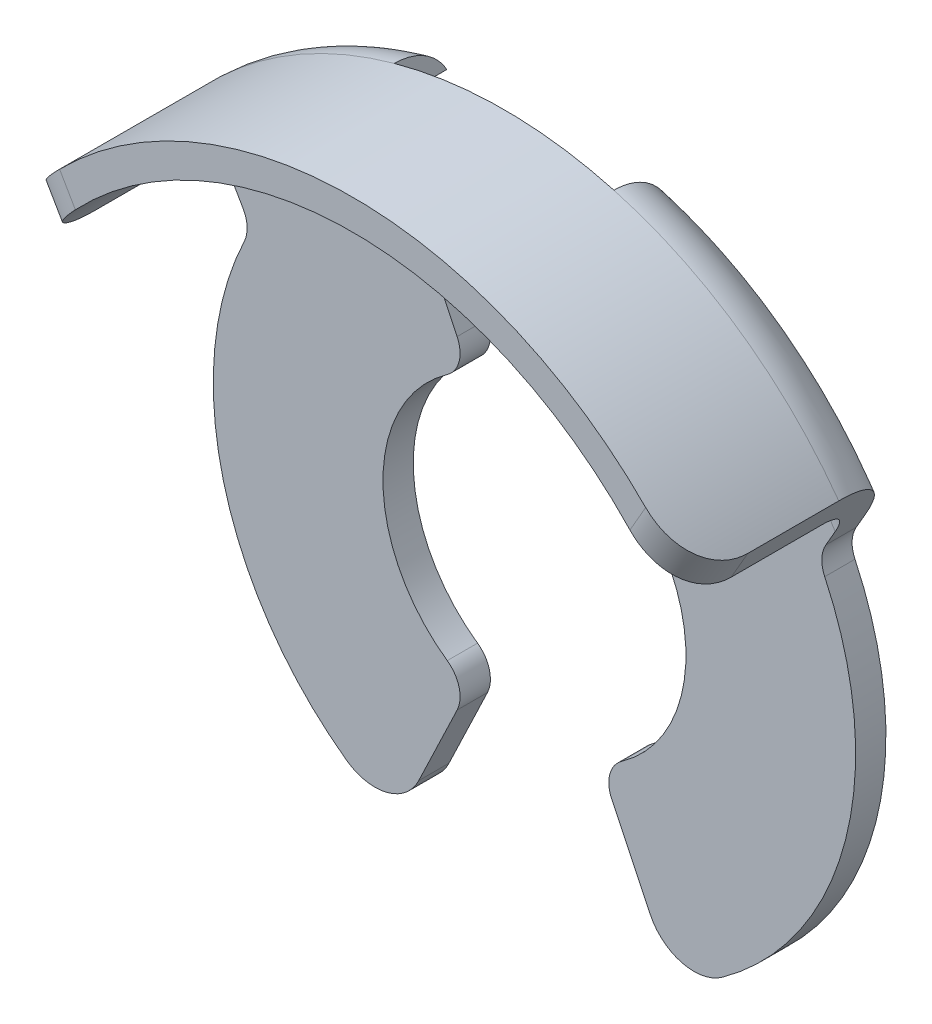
ISO-10303-21;
HEADER;
FILE_DESCRIPTION(('STEP AP214'),'2;1');
FILE_NAME('part.step','',(''),(''),'','','');
FILE_SCHEMA(('AUTOMOTIVE_DESIGN { 1 0 10303 214 1 1 1 1 }'));
ENDSEC;
DATA;
#1=APPLICATION_CONTEXT('core data for automotive mechanical design processes');
#2=APPLICATION_PROTOCOL_DEFINITION('international standard','automotive_design',2000,#1);
#3=PRODUCT_CONTEXT('',#1,'mechanical');
#4=PRODUCT('Part','Part','',(#3));
#5=PRODUCT_RELATED_PRODUCT_CATEGORY('part','',(#4));
#6=PRODUCT_DEFINITION_FORMATION('','',#4);
#7=PRODUCT_DEFINITION_CONTEXT('part definition',#1,'design');
#8=PRODUCT_DEFINITION('design','',#6,#7);
#9=PRODUCT_DEFINITION_SHAPE('','',#8);
#10=(LENGTH_UNIT() NAMED_UNIT(*) SI_UNIT(.MILLI.,.METRE.));
#11=(NAMED_UNIT(*) PLANE_ANGLE_UNIT() SI_UNIT($,.RADIAN.));
#12=(NAMED_UNIT(*) SI_UNIT($,.STERADIAN.) SOLID_ANGLE_UNIT());
#13=UNCERTAINTY_MEASURE_WITH_UNIT(LENGTH_MEASURE(1.E-05),#10,'distance_accuracy_value','');
#14=(GEOMETRIC_REPRESENTATION_CONTEXT(3) GLOBAL_UNCERTAINTY_ASSIGNED_CONTEXT((#13)) GLOBAL_UNIT_ASSIGNED_CONTEXT((#10,
#11,#12)) REPRESENTATION_CONTEXT('',''));
#15=CARTESIAN_POINT('',(0.,0.,0.));
#16=DIRECTION('',(0.,0.,1.));
#17=DIRECTION('',(1.,0.,0.));
#18=AXIS2_PLACEMENT_3D('',#15,#16,#17);
#19=CARTESIAN_POINT('',(0.,0.,-3.));
#20=DIRECTION('',(0.,0.,1.));
#21=DIRECTION('',(1.,0.,0.));
#22=AXIS2_PLACEMENT_3D('',#19,#20,#21);
#23=CYLINDRICAL_SURFACE('',#22,6.3);
#24=DIRECTION('',(0.,0.,1.));
#25=VECTOR('',#24,1.);
#26=CARTESIAN_POINT('',(1.81168830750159,6.03388643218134,-3.));
#27=LINE('',#26,#25);
#28=CARTESIAN_POINT('',(1.81168830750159,6.03388643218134,-3.36602540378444));
#29=VERTEX_POINT('',#28);
#30=CARTESIAN_POINT('',(1.81168830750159,6.03388643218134,-2.5));
#31=VERTEX_POINT('',#30);
#32=EDGE_CURVE('E261',#29,#31,#27,.T.);
#33=ORIENTED_EDGE('',*,*,#32,.F.);
#34=CARTESIAN_POINT('',(0.,0.,-3.36602540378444));
#35=DIRECTION('',(0.,0.,1.));
#36=DIRECTION('',(1.,0.,0.));
#37=AXIS2_PLACEMENT_3D('',#34,#35,#36);
#38=CIRCLE('',#37,6.3);
#39=CARTESIAN_POINT('',(1.86205919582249,6.01853267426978,-3.36602540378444));
#40=VERTEX_POINT('',#39);
#41=EDGE_CURVE('E700',#29,#40,#38,.F.);
#42=ORIENTED_EDGE('',*,*,#41,.T.);
#43=DIRECTION('',(0.,0.,1.));
#44=VECTOR('',#43,1.);
#45=CARTESIAN_POINT('',(1.86205919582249,6.01853267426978,-3.5));
#46=LINE('',#45,#44);
#47=CARTESIAN_POINT('',(1.86205919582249,6.01853267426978,-2.5));
#48=VERTEX_POINT('',#47);
#49=EDGE_CURVE('E69',#40,#48,#46,.T.);
#50=ORIENTED_EDGE('',*,*,#49,.T.);
#51=CARTESIAN_POINT('',(0.,0.,-2.5));
#52=DIRECTION('',(0.,0.,1.));
#53=DIRECTION('',(1.,0.,0.));
#54=AXIS2_PLACEMENT_3D('',#51,#52,#53);
#55=CIRCLE('',#54,6.3);
#56=CARTESIAN_POINT('',(5.24494378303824,3.49006657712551,-2.5));
#57=VERTEX_POINT('',#56);
#58=EDGE_CURVE('E605',#48,#57,#55,.F.);
#59=ORIENTED_EDGE('',*,*,#58,.T.);
#60=DIRECTION('',(0.,0.,1.));
#61=VECTOR('',#60,1.);
#62=CARTESIAN_POINT('',(5.24494378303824,3.49006657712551,-3.));
#63=LINE('',#62,#61);
#64=CARTESIAN_POINT('',(5.24494378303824,3.49006657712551,-1.));
#65=VERTEX_POINT('',#64);
#66=EDGE_CURVE('E412',#57,#65,#63,.T.);
#67=ORIENTED_EDGE('',*,*,#66,.T.);
#68=CARTESIAN_POINT('',(5.24494378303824,3.49006657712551,-1.));
#69=CARTESIAN_POINT('',(5.24494400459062,3.4900643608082,-0.973740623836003));
#70=CARTESIAN_POINT('',(5.2443039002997,3.49102838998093,-0.947494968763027));
#71=CARTESIAN_POINT('',(5.24175263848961,3.49485868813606,-0.895213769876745));
#72=CARTESIAN_POINT('',(5.2398419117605,3.4977243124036,-0.869178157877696));
#73=CARTESIAN_POINT('',(5.23224241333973,3.50909200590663,-0.791886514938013));
#74=CARTESIAN_POINT('',(5.22468608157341,3.5203655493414,-0.741185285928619));
#75=CARTESIAN_POINT('',(5.20483590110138,3.54964655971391,-0.642844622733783));
#76=CARTESIAN_POINT('',(5.19254623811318,3.56764807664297,-0.595202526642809));
#77=CARTESIAN_POINT('',(5.16355303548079,3.609482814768,-0.50396438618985));
#78=CARTESIAN_POINT('',(5.14684583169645,3.63332087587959,-0.460371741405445));
#79=CARTESIAN_POINT('',(5.10842817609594,3.68715434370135,-0.376002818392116));
#80=CARTESIAN_POINT('',(5.08650509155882,3.71740281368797,-0.335485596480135));
#81=CARTESIAN_POINT('',(5.03862377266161,3.78204819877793,-0.260612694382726));
#82=CARTESIAN_POINT('',(5.01266390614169,3.81644679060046,-0.226259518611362));
#83=CARTESIAN_POINT('',(4.95458889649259,3.89159369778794,-0.161439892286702));
#84=CARTESIAN_POINT('',(4.9221270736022,3.93263503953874,-0.131622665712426));
#85=CARTESIAN_POINT('',(4.85354230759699,4.01697426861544,-0.080676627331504));
#86=CARTESIAN_POINT('',(4.8174200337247,4.06027174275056,-0.0595462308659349));
#87=CARTESIAN_POINT('',(4.74755925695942,4.14163300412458,-0.0288628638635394));
#88=CARTESIAN_POINT('',(4.71420455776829,4.17957236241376,-0.0180962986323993));
#89=CARTESIAN_POINT('',(4.64591680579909,4.25536261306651,-0.00365938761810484));
#90=CARTESIAN_POINT('',(4.6109840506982,4.29321352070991,1.22908386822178E-05));
#91=CARTESIAN_POINT('',(4.57554492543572,4.33063374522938,0.));
#92=B_SPLINE_CURVE_WITH_KNOTS('',3,(#68,#69,#70,#71,#72,#73,#74,#75,#76,#77,#78,#79,#80,#81,#82,
#83,#84,#85,#86,#87,#88,#89,#90,#91),.UNSPECIFIED.,.F.,.F.,(4,2,2,2,2,2,2,2,2,2,2,4),(0.,
0.0787259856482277,0.157425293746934,0.314053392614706,0.470543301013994,0.627163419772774,
0.791815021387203,0.956533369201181,1.13642000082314,1.31627380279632,1.47072749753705,
1.62515217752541),.UNSPECIFIED.);
#93=CARTESIAN_POINT('',(4.57554492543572,4.33063374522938,0.));
#94=VERTEX_POINT('',#93);
#95=EDGE_CURVE('E466',#65,#94,#92,.T.);
#96=ORIENTED_EDGE('',*,*,#95,.T.);
#97=CARTESIAN_POINT('',(0.,0.,0.));
#98=DIRECTION('',(0.,0.,1.));
#99=DIRECTION('',(1.,0.,0.));
#100=AXIS2_PLACEMENT_3D('',#97,#98,#99);
#101=CIRCLE('',#100,6.3);
#102=CARTESIAN_POINT('',(-4.57554492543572,4.33063374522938,0.));
#103=VERTEX_POINT('',#102);
#104=EDGE_CURVE('E398',#94,#103,#101,.T.);
#105=ORIENTED_EDGE('',*,*,#104,.T.);
#106=CARTESIAN_POINT('',(-4.57554492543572,4.33063374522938,0.));
#107=CARTESIAN_POINT('',(-4.61820504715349,4.28561009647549,2.81917269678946E-05));
#108=CARTESIAN_POINT('',(-4.660115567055,4.23994933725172,-0.00529870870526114));
#109=CARTESIAN_POINT('',(-4.74142729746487,4.14879264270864,-0.0261289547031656));
#110=CARTESIAN_POINT('',(-4.7808310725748,4.10329658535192,-0.0416217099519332));
#111=CARTESIAN_POINT('',(-4.8561978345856,4.01382567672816,-0.0822444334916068));
#112=CARTESIAN_POINT('',(-4.89216210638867,3.9698502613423,-0.107370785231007));
#113=CARTESIAN_POINT('',(-4.95994440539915,3.88482969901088,-0.166619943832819));
#114=CARTESIAN_POINT('',(-4.9917612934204,3.84378535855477,-0.200745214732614));
#115=CARTESIAN_POINT('',(-5.05087435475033,3.76577898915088,-0.277637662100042));
#116=CARTESIAN_POINT('',(-5.07812260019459,3.72886144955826,-0.320487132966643));
#117=CARTESIAN_POINT('',(-5.12706499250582,3.6612769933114,-0.413679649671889));
#118=CARTESIAN_POINT('',(-5.14875991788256,3.63060920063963,-0.46402164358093));
#119=CARTESIAN_POINT('',(-5.18491780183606,3.57876716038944,-0.567901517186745));
#120=CARTESIAN_POINT('',(-5.1997159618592,3.55715966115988,-0.621105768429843));
#121=CARTESIAN_POINT('',(-5.22326729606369,3.52248863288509,-0.731441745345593));
#122=CARTESIAN_POINT('',(-5.23203346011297,3.50940674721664,-0.788564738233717));
#123=CARTESIAN_POINT('',(-5.240056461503,3.49740241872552,-0.871934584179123));
#124=CARTESIAN_POINT('',(-5.24188832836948,3.49465494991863,-0.897447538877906));
#125=CARTESIAN_POINT('',(-5.24433108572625,3.49098764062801,-0.948635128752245));
#126=CARTESIAN_POINT('',(-5.24494327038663,3.49006586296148,-0.974309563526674));
#127=CARTESIAN_POINT('',(-5.24494378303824,3.49006657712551,-1.));
#128=B_SPLINE_CURVE_WITH_KNOTS('',3,(#106,#107,#108,#109,#110,#111,#112,#113,#114,#115,#116,
#117,#118,#119,#120,#121,#122,#123,#124,#125,#126,#127),.UNSPECIFIED.,.F.,.F.,(4,2,2,2,2,2,2,2,
2,2,4),(0.,0.185763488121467,0.371333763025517,0.55683444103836,0.742385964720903,
0.929776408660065,1.11714056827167,1.29408063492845,1.47063845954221,1.54773646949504,
1.62475262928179),.UNSPECIFIED.);
#129=CARTESIAN_POINT('',(-5.24494378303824,3.49006657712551,-1.));
#130=VERTEX_POINT('',#129);
#131=EDGE_CURVE('E457',#103,#130,#128,.T.);
#132=ORIENTED_EDGE('',*,*,#131,.T.);
#133=DIRECTION('',(0.,0.,1.));
#134=VECTOR('',#133,1.);
#135=CARTESIAN_POINT('',(-5.24494378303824,3.49006657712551,-3.));
#136=LINE('',#135,#134);
#137=CARTESIAN_POINT('',(-5.24494378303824,3.49006657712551,-2.5));
#138=VERTEX_POINT('',#137);
#139=EDGE_CURVE('E419',#130,#138,#136,.F.);
#140=ORIENTED_EDGE('',*,*,#139,.T.);
#141=CARTESIAN_POINT('',(0.,0.,-2.5));
#142=DIRECTION('',(0.,0.,1.));
#143=DIRECTION('',(1.,0.,0.));
#144=AXIS2_PLACEMENT_3D('',#141,#142,#143);
#145=CIRCLE('',#144,6.3);
#146=CARTESIAN_POINT('',(-1.86205919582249,6.01853267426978,-2.5));
#147=VERTEX_POINT('',#146);
#148=EDGE_CURVE('E601',#138,#147,#145,.F.);
#149=ORIENTED_EDGE('',*,*,#148,.T.);
#150=DIRECTION('',(0.,0.,1.));
#151=VECTOR('',#150,1.);
#152=CARTESIAN_POINT('',(-1.86205919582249,6.01853267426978,-3.5));
#153=LINE('',#152,#151);
#154=CARTESIAN_POINT('',(-1.86205919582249,6.01853267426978,-3.36602540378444));
#155=VERTEX_POINT('',#154);
#156=EDGE_CURVE('E349',#155,#147,#153,.T.);
#157=ORIENTED_EDGE('',*,*,#156,.F.);
#158=CARTESIAN_POINT('',(-1.81168830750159,6.03388643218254,-3.36602540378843));
#159=VERTEX_POINT('',#158);
#160=EDGE_CURVE('E702',#155,#159,#38,.F.);
#161=ORIENTED_EDGE('',*,*,#160,.T.);
#162=DIRECTION('',(0.,0.,1.));
#163=VECTOR('',#162,1.);
#164=CARTESIAN_POINT('',(-1.81168830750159,6.03388643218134,-3.));
#165=LINE('',#164,#163);
#166=CARTESIAN_POINT('',(-1.81168830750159,6.03388643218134,-2.5));
#167=VERTEX_POINT('',#166);
#168=EDGE_CURVE('E269',#167,#159,#165,.F.);
#169=ORIENTED_EDGE('',*,*,#168,.F.);
#170=CARTESIAN_POINT('',(0.,0.,-2.5));
#171=DIRECTION('',(0.,0.,-1.));
#172=DIRECTION('',(-1.,0.,0.));
#173=AXIS2_PLACEMENT_3D('',#170,#171,#172);
#174=CIRCLE('',#173,6.3);
#175=EDGE_CURVE('E273',#31,#167,#174,.F.);
#176=ORIENTED_EDGE('',*,*,#175,.F.);
#177=EDGE_LOOP('',(#33,#42,#50,#59,#67,#96,#105,#132,#140,#149,#157,#161,#169,#176));
#178=FACE_BOUND('',#177,.T.);
#179=ADVANCED_FACE('F39',(#178),#23,.F.);
#180=CARTESIAN_POINT('',(0.,0.,-2.5));
#181=DIRECTION('',(0.,0.,1.));
#182=DIRECTION('',(1.,0.,0.));
#183=AXIS2_PLACEMENT_3D('',#180,#181,#182);
#184=TOROIDAL_SURFACE('',#183,5.8,1.);
#185=ORIENTED_EDGE('',*,*,#41,.F.);
#186=CARTESIAN_POINT('',(1.81168830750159,4.51330074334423,-2.85024607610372));
#187=CARTESIAN_POINT('',(1.81168830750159,4.53450938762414,-2.90287287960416));
#188=CARTESIAN_POINT('',(1.81168830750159,4.56042379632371,-2.95366535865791));
#189=CARTESIAN_POINT('',(1.81168830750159,4.62058198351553,-3.05012506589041));
#190=CARTESIAN_POINT('',(1.81168830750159,4.65484238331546,-3.09578179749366));
#191=CARTESIAN_POINT('',(1.81168830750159,4.7302919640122,-3.18066607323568));
#192=CARTESIAN_POINT('',(1.81168830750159,4.77145733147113,-3.21991482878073));
#193=CARTESIAN_POINT('',(1.81168830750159,4.85948529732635,-3.29133509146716));
#194=CARTESIAN_POINT('',(1.81168830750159,4.90634630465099,-3.32350856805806));
#195=CARTESIAN_POINT('',(1.81168830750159,5.00699290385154,-3.38163070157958));
#196=CARTESIAN_POINT('',(1.81168830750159,5.06100946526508,-3.40717952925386));
#197=CARTESIAN_POINT('',(1.81168830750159,5.17244853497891,-3.44928195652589));
#198=CARTESIAN_POINT('',(1.81168830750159,5.22987209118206,-3.46583277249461));
#199=CARTESIAN_POINT('',(1.81168830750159,5.34915537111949,-3.49007217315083));
#200=CARTESIAN_POINT('',(1.81168830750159,5.41109958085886,-3.49734721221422));
#201=CARTESIAN_POINT('',(1.81168830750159,5.53533954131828,-3.50144630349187));
#202=CARTESIAN_POINT('',(1.81168830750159,5.59763531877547,-3.49826954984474));
#203=CARTESIAN_POINT('',(1.81168830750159,5.72104316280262,-3.48139198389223));
#204=CARTESIAN_POINT('',(1.81168830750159,5.7821496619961,-3.46765015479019));
#205=CARTESIAN_POINT('',(1.81168830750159,5.90107211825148,-3.42980415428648));
#206=CARTESIAN_POINT('',(1.81168830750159,5.95888850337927,-3.40570133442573));
#207=CARTESIAN_POINT('',(1.81168830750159,6.06779609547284,-3.34847909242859));
#208=CARTESIAN_POINT('',(1.81168830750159,6.11903130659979,-3.3156341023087));
#209=CARTESIAN_POINT('',(1.81168830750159,6.21493977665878,-3.24145243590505));
#210=CARTESIAN_POINT('',(1.81168830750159,6.25961461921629,-3.20011781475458));
#211=CARTESIAN_POINT('',(1.81168830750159,6.33910688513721,-3.11201269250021));
#212=CARTESIAN_POINT('',(1.81168830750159,6.3742616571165,-3.06554655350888));
#213=CARTESIAN_POINT('',(1.81168830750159,6.4358982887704,-2.96717821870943));
#214=CARTESIAN_POINT('',(1.81168830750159,6.46238224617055,-2.91527734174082));
#215=CARTESIAN_POINT('',(1.81168830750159,6.50488372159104,-2.80968566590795));
#216=CARTESIAN_POINT('',(1.81168830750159,6.52126627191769,-2.75614162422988));
#217=CARTESIAN_POINT('',(1.81168830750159,6.54456785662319,-2.64703373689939));
#218=CARTESIAN_POINT('',(1.81168830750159,6.55148839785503,-2.5914702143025));
#219=CARTESIAN_POINT('',(1.81168830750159,6.55557611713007,-2.48129335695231));
#220=CARTESIAN_POINT('',(1.81168830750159,6.5529677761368,-2.42668821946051));
#221=CARTESIAN_POINT('',(1.81168830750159,6.53858627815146,-2.31870178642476));
#222=CARTESIAN_POINT('',(1.81168830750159,6.52681358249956,-2.26532042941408));
#223=CARTESIAN_POINT('',(1.81168830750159,6.49454960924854,-2.16145237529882));
#224=CARTESIAN_POINT('',(1.81168830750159,6.47408607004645,-2.11095704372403));
#225=CARTESIAN_POINT('',(1.81168830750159,6.42510816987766,-2.01403995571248));
#226=CARTESIAN_POINT('',(1.81168830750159,6.3965933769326,-1.96761841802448));
#227=CARTESIAN_POINT('',(1.81168830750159,6.33185328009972,-1.87929093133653));
#228=CARTESIAN_POINT('',(1.81168830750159,6.29550544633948,-1.83747488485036));
#229=CARTESIAN_POINT('',(1.81168830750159,6.21650768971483,-1.76030068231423));
#230=CARTESIAN_POINT('',(1.81168830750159,6.17385690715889,-1.72494340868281));
#231=CARTESIAN_POINT('',(1.81168830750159,6.08198170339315,-1.66042178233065));
#232=CARTESIAN_POINT('',(1.81168830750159,6.0325867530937,-1.63150040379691));
#233=CARTESIAN_POINT('',(1.81168830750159,5.92978963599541,-1.58198535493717));
#234=CARTESIAN_POINT('',(1.81168830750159,5.8763867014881,-1.56139328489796));
#235=CARTESIAN_POINT('',(1.81168830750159,5.76474596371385,-1.52822905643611));
#236=CARTESIAN_POINT('',(1.81168830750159,5.70639961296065,-1.51602225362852));
#237=CARTESIAN_POINT('',(1.81168830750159,5.58850151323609,-1.50119410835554));
#238=CARTESIAN_POINT('',(1.81168830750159,5.52894951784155,-1.49857474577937));
#239=CARTESIAN_POINT('',(1.81168830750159,5.40799151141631,-1.50296435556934));
#240=CARTESIAN_POINT('',(1.81168830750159,5.3465983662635,-1.51033292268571));
#241=CARTESIAN_POINT('',(1.81168830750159,5.22586215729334,-1.53510053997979));
#242=CARTESIAN_POINT('',(1.81168830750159,5.16651943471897,-1.55250125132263));
#243=CARTESIAN_POINT('',(1.81168830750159,5.05064049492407,-1.5972676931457));
#244=CARTESIAN_POINT('',(1.81168830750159,4.99416254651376,-1.62478473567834));
#245=CARTESIAN_POINT('',(1.81168830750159,4.88675897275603,-1.68911664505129));
#246=CARTESIAN_POINT('',(1.81168830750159,4.83583321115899,-1.72593128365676));
#247=CARTESIAN_POINT('',(1.81168830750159,4.74235022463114,-1.80706195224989));
#248=CARTESIAN_POINT('',(1.81168830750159,4.69962955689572,-1.85118915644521));
#249=CARTESIAN_POINT('',(1.81168830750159,4.6227887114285,-1.94639217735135));
#250=CARTESIAN_POINT('',(1.81168830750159,4.58866462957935,-1.99746482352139));
#251=CARTESIAN_POINT('',(1.81168830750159,4.53230558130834,-2.10177178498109));
#252=CARTESIAN_POINT('',(1.81168830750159,4.50946931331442,-2.15468087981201));
#253=CARTESIAN_POINT('',(1.81168830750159,4.47372706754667,-2.26376920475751));
#254=CARTESIAN_POINT('',(1.81168830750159,4.46081893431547,-2.31994772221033));
#255=CARTESIAN_POINT('',(1.81168830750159,4.4460770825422,-2.42993059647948));
#256=CARTESIAN_POINT('',(1.81168830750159,4.44356580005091,-2.4836453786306));
#257=CARTESIAN_POINT('',(1.81168830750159,4.44787075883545,-2.590644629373));
#258=CARTESIAN_POINT('',(1.81168830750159,4.45467236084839,-2.64392964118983));
#259=CARTESIAN_POINT('',(1.81168830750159,4.47162869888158,-2.72248850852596));
#260=CARTESIAN_POINT('',(1.81168830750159,4.47843932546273,-2.74852808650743));
#261=CARTESIAN_POINT('',(1.81168830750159,4.49424777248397,-2.79993119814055));
#262=CARTESIAN_POINT('',(1.81168830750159,4.50324536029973,-2.8252948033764));
#263=CARTESIAN_POINT('',(1.81168830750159,4.51330074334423,-2.85024607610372));
#264=B_SPLINE_CURVE_WITH_KNOTS('',3,(#186,#187,#188,#189,#190,#191,#192,#193,#194,#195,#196,
#197,#198,#199,#200,#201,#202,#203,#204,#205,#206,#207,#208,#209,#210,#211,#212,#213,#214,#215,
#216,#217,#218,#219,#220,#221,#222,#223,#224,#225,#226,#227,#228,#229,#230,#231,#232,#233,#234,
#235,#236,#237,#238,#239,#240,#241,#242,#243,#244,#245,#246,#247,#248,#249,#250,#251,#252,#253,
#254,#255,#256,#257,#258,#259,#260,#261,#262,#263),.UNSPECIFIED.,.T.,.F.,(4,2,2,2,2,2,2,2,2,2,2,
2,2,2,2,2,2,2,2,2,2,2,2,2,2,2,2,2,2,2,2,2,2,2,2,2,2,2,4),(0.,0.170112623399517,
0.340566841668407,0.510444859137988,0.680275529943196,0.858743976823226,1.03726760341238,
1.22350014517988,1.4097470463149,1.59672068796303,1.78366994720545,1.96532929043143,
2.14694471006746,2.32086835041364,2.49474988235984,2.66190951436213,2.82904252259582,
2.99226387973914,3.15547702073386,3.31817310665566,3.4808779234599,3.64634128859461,
3.81182724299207,3.98277624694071,4.15375807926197,4.33178403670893,4.50984675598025,
4.69449345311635,4.87917073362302,5.06673079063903,5.25428624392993,5.43759290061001,
5.62081615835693,5.79279054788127,5.9647275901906,6.12526391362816,6.28554817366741,
6.36621007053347,6.44686339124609),.UNSPECIFIED.);
#265=CARTESIAN_POINT('',(1.81168830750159,6.55421890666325,-2.5));
#266=VERTEX_POINT('',#265);
#267=EDGE_CURVE('E11',#29,#266,#264,.T.);
#268=ORIENTED_EDGE('',*,*,#267,.T.);
#269=CARTESIAN_POINT('',(0.,0.,-2.5));
#270=DIRECTION('',(0.,0.,1.));
#271=DIRECTION('',(1.,0.,0.));
#272=AXIS2_PLACEMENT_3D('',#269,#270,#271);
#273=CIRCLE('',#272,6.8);
#274=CARTESIAN_POINT('',(5.5214787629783,3.96903921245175,-2.5));
#275=VERTEX_POINT('',#274);
#276=EDGE_CURVE('E696',#275,#266,#273,.T.);
#277=ORIENTED_EDGE('',*,*,#276,.F.);
#278=CARTESIAN_POINT('',(4.96291509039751,3.00157855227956,-3.5));
#279=CARTESIAN_POINT('',(4.99759595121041,3.06164756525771,-3.50003179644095));
#280=CARTESIAN_POINT('',(5.03231814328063,3.1217881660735,-3.49446062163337));
#281=CARTESIAN_POINT('',(5.10098140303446,3.24071642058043,-3.4719200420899));
#282=CARTESIAN_POINT('',(5.13491818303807,3.29949664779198,-3.45489873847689));
#283=CARTESIAN_POINT('',(5.20090725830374,3.4137930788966,-3.40919625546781));
#284=CARTESIAN_POINT('',(5.23295379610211,3.46929931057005,-3.38048136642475));
#285=CARTESIAN_POINT('',(5.2937884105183,3.57466795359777,-3.3116939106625));
#286=CARTESIAN_POINT('',(5.32258293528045,3.6245415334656,-3.27164439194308));
#287=CARTESIAN_POINT('',(5.37326336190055,3.71232260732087,-3.18509857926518));
#288=CARTESIAN_POINT('',(5.39553908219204,3.75090528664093,-3.13951716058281));
#289=CARTESIAN_POINT('',(5.43539388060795,3.8199358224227,-3.04070890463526));
#290=CARTESIAN_POINT('',(5.45297345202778,3.85038453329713,-2.98748287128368));
#291=CARTESIAN_POINT('',(5.48093850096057,3.89882141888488,-2.88118532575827));
#292=CARTESIAN_POINT('',(5.49189366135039,3.9177963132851,-2.82871055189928));
#293=CARTESIAN_POINT('',(5.50883160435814,3.94713369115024,-2.72069863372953));
#294=CARTESIAN_POINT('',(5.51482521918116,3.95751493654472,-2.66516844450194));
#295=CARTESIAN_POINT('',(5.51929579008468,3.96525819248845,-2.59098219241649));
#296=CARTESIAN_POINT('',(5.52011453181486,3.9666762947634,-2.57280990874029));
#297=CARTESIAN_POINT('',(5.52120524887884,3.96856547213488,-2.53642805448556));
#298=CARTESIAN_POINT('',(5.52147806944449,3.96903801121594,-2.51821858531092));
#299=CARTESIAN_POINT('',(5.52147876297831,3.96903921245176,-2.5));
#300=B_SPLINE_CURVE_WITH_KNOTS('',3,(#278,#279,#280,#281,#282,#283,#284,#285,#286,#287,#288,
#289,#290,#291,#292,#293,#294,#295,#296,#297,#298,#299),.UNSPECIFIED.,.F.,.F.,(4,2,2,2,2,2,2,2,
2,2,4),(0.,0.207991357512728,0.41693186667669,0.626479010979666,0.83560308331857,
1.02574914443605,1.21587522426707,1.38559214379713,1.55493754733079,1.60965173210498,
1.66428113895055),.UNSPECIFIED.);
#301=CARTESIAN_POINT('',(4.96291509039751,3.00157855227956,-3.5));
#302=VERTEX_POINT('',#301);
#303=EDGE_CURVE('E526',#302,#275,#300,.T.);
#304=ORIENTED_EDGE('',*,*,#303,.F.);
#305=CARTESIAN_POINT('',(0.,0.,-3.5));
#306=DIRECTION('',(0.,0.,1.));
#307=DIRECTION('',(1.,0.,0.));
#308=AXIS2_PLACEMENT_3D('',#305,#306,#307);
#309=CIRCLE('',#308,5.8);
#310=CARTESIAN_POINT('',(2.4254808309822,5.26849530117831,-3.5));
#311=VERTEX_POINT('',#310);
#312=EDGE_CURVE('E694',#311,#302,#309,.F.);
#313=ORIENTED_EDGE('',*,*,#312,.F.);
#314=CARTESIAN_POINT('',(1.86205919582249,6.01853267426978,-3.36602540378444));
#315=CARTESIAN_POINT('',(1.88252382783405,6.01220254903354,-3.36602066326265));
#316=CARTESIAN_POINT('',(1.90272177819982,6.00505100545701,-3.36645968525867));
#317=CARTESIAN_POINT('',(1.94243859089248,5.98917245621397,-3.36818063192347));
#318=CARTESIAN_POINT('',(1.96195783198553,5.9804463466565,-3.3694620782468));
#319=CARTESIAN_POINT('',(2.01907893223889,5.9521113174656,-3.37448334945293));
#320=CARTESIAN_POINT('',(2.0554984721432,5.93026636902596,-3.37940119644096));
#321=CARTESIAN_POINT('',(2.12408412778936,5.88140691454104,-3.39156298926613));
#322=CARTESIAN_POINT('',(2.15625807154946,5.8544021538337,-3.39880256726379));
#323=CARTESIAN_POINT('',(2.21590407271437,5.79584583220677,-3.41455842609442));
#324=CARTESIAN_POINT('',(2.24336704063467,5.76428569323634,-3.42307711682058));
#325=CARTESIAN_POINT('',(2.29478826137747,5.69494313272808,-3.44084147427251));
#326=CARTESIAN_POINT('',(2.31836460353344,5.6568793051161,-3.45009615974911));
#327=CARTESIAN_POINT('',(2.35890741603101,5.57717643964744,-3.46730077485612));
#328=CARTESIAN_POINT('',(2.37588595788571,5.53554410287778,-3.47525307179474));
#329=CARTESIAN_POINT('',(2.40050091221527,5.45664227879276,-3.48733480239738));
#330=CARTESIAN_POINT('',(2.40921100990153,5.41977268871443,-3.49187673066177));
#331=CARTESIAN_POINT('',(2.42138399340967,5.34481789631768,-3.49822103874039));
#332=CARTESIAN_POINT('',(2.42482720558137,5.30672867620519,-3.50001314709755));
#333=CARTESIAN_POINT('',(2.4254808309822,5.26849530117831,-3.5));
#334=B_SPLINE_CURVE_WITH_KNOTS('',3,(#314,#315,#316,#317,#318,#319,#320,#321,#322,#323,#324,
#325,#326,#327,#328,#329,#330,#331,#332,#333),.UNSPECIFIED.,.F.,.F.,(4,2,2,2,2,2,2,2,2,4),(0.,
0.0642191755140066,0.128401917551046,0.25597952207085,0.38331851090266,0.510900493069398,
0.647448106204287,0.783744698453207,0.897752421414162,1.01218497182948),.UNSPECIFIED.);
#335=EDGE_CURVE('E703',#40,#311,#334,.T.);
#336=ORIENTED_EDGE('',*,*,#335,.F.);
#337=EDGE_LOOP('',(#185,#268,#277,#304,#313,#336));
#338=FACE_BOUND('',#337,.T.);
#339=ADVANCED_FACE('F483',(#338),#184,.T.);
#340=CARTESIAN_POINT('',(-1.81168830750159,6.55421890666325,-2.5));
#341=VERTEX_POINT('',#340);
#342=CARTESIAN_POINT('',(-5.5214787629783,3.96903921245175,-2.5));
#343=VERTEX_POINT('',#342);
#344=EDGE_CURVE('E699',#341,#343,#273,.T.);
#345=ORIENTED_EDGE('',*,*,#344,.F.);
#346=CARTESIAN_POINT('',(-1.81168830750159,4.51330074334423,-2.85024607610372));
#347=CARTESIAN_POINT('',(-1.81168830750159,4.49367465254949,-2.80153258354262));
#348=CARTESIAN_POINT('',(-1.81168830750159,4.47804949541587,-2.75117814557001));
#349=CARTESIAN_POINT('',(-1.81168830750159,4.45545398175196,-2.64853516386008));
#350=CARTESIAN_POINT('',(-1.81168830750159,4.44848846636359,-2.59624555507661));
#351=CARTESIAN_POINT('',(-1.81168830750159,4.4435239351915,-2.49122039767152));
#352=CARTESIAN_POINT('',(-1.81168830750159,4.44552785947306,-2.43848470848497));
#353=CARTESIAN_POINT('',(-1.81168830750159,4.45842152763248,-2.33412188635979));
#354=CARTESIAN_POINT('',(-1.81168830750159,4.46931049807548,-2.28249465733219));
#355=CARTESIAN_POINT('',(-1.81168830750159,4.4994355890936,-2.18202622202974));
#356=CARTESIAN_POINT('',(-1.81168830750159,4.51863027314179,-2.13317252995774));
#357=CARTESIAN_POINT('',(-1.81168830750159,4.56462132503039,-2.03919303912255));
#358=CARTESIAN_POINT('',(-1.81168830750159,4.5914190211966,-1.99406789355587));
#359=CARTESIAN_POINT('',(-1.81168830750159,4.65299563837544,-1.90671790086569));
#360=CARTESIAN_POINT('',(-1.81168830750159,4.68806656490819,-1.86469925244));
#361=CARTESIAN_POINT('',(-1.81168830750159,4.76435827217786,-1.7866821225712));
#362=CARTESIAN_POINT('',(-1.81168830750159,4.8055808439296,-1.75068540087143));
#363=CARTESIAN_POINT('',(-1.81168830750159,4.89596700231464,-1.68319368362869));
#364=CARTESIAN_POINT('',(-1.81168830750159,4.94547810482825,-1.65216389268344));
#365=CARTESIAN_POINT('',(-1.81168830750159,5.04879650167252,-1.59835200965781));
#366=CARTESIAN_POINT('',(-1.81168830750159,5.10260502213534,-1.57557228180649));
#367=CARTESIAN_POINT('',(-1.81168830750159,5.21614763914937,-1.53771508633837));
#368=CARTESIAN_POINT('',(-1.81168830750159,5.27604485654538,-1.52312534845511));
#369=CARTESIAN_POINT('',(-1.81168830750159,5.39742889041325,-1.50399886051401));
#370=CARTESIAN_POINT('',(-1.81168830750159,5.45891594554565,-1.49946362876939));
#371=CARTESIAN_POINT('',(-1.81168830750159,5.58294455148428,-1.50064810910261));
#372=CARTESIAN_POINT('',(-1.81168830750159,5.64548447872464,-1.50655983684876));
#373=CARTESIAN_POINT('',(-1.81168830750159,5.76863889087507,-1.52899425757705));
#374=CARTESIAN_POINT('',(-1.81168830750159,5.82925348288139,-1.54551635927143));
#375=CARTESIAN_POINT('',(-1.81168830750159,5.9456156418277,-1.58848478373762));
#376=CARTESIAN_POINT('',(-1.81168830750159,6.00143158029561,-1.61474552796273));
#377=CARTESIAN_POINT('',(-1.81168830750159,6.10760898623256,-1.6766359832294));
#378=CARTESIAN_POINT('',(-1.81168830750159,6.15797162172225,-1.71226368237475));
#379=CARTESIAN_POINT('',(-1.81168830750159,6.24966515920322,-1.79038717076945));
#380=CARTESIAN_POINT('',(-1.81168830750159,6.29127387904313,-1.83255676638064));
#381=CARTESIAN_POINT('',(-1.81168830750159,6.36644311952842,-1.92354811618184));
#382=CARTESIAN_POINT('',(-1.81168830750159,6.40000568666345,-1.97236817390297));
#383=CARTESIAN_POINT('',(-1.81168830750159,6.45666513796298,-2.07306657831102));
#384=CARTESIAN_POINT('',(-1.81168830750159,6.48014049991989,-2.12473211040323));
#385=CARTESIAN_POINT('',(-1.81168830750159,6.51777798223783,-2.23135051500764));
#386=CARTESIAN_POINT('',(-1.81168830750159,6.53194192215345,-2.28630274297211));
#387=CARTESIAN_POINT('',(-1.81168830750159,6.55017507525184,-2.39615999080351));
#388=CARTESIAN_POINT('',(-1.81168830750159,6.5545340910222,-2.45101707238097));
#389=CARTESIAN_POINT('',(-1.81168830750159,6.55386828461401,-2.5606716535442));
#390=CARTESIAN_POINT('',(-1.81168830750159,6.54884432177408,-2.61546915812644));
#391=CARTESIAN_POINT('',(-1.81168830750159,6.52969175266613,-2.72282705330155));
#392=CARTESIAN_POINT('',(-1.81168830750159,6.51566298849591,-2.77540531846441));
#393=CARTESIAN_POINT('',(-1.81168830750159,6.47905998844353,-2.87749358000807));
#394=CARTESIAN_POINT('',(-1.81168830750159,6.45648560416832,-2.92700352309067));
#395=CARTESIAN_POINT('',(-1.81168830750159,6.40325401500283,-3.02210027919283));
#396=CARTESIAN_POINT('',(-1.81168830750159,6.37252001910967,-3.06764405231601));
#397=CARTESIAN_POINT('',(-1.81168830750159,6.30403430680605,-3.15310132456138));
#398=CARTESIAN_POINT('',(-1.81168830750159,6.26628183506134,-3.1930142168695));
#399=CARTESIAN_POINT('',(-1.81168830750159,6.18374182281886,-3.2672897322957));
#400=CARTESIAN_POINT('',(-1.81168830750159,6.13878807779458,-3.30146751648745));
#401=CARTESIAN_POINT('',(-1.81168830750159,6.04396114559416,-3.36212459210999));
#402=CARTESIAN_POINT('',(-1.81168830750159,5.99408708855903,-3.38860251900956));
#403=CARTESIAN_POINT('',(-1.81168830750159,5.88874969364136,-3.43422298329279));
#404=CARTESIAN_POINT('',(-1.81168830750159,5.83314365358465,-3.45303593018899));
#405=CARTESIAN_POINT('',(-1.81168830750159,5.71962954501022,-3.4814618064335));
#406=CARTESIAN_POINT('',(-1.81168830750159,5.66172100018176,-3.49107282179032));
#407=CARTESIAN_POINT('',(-1.81168830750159,5.54275805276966,-3.50118800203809));
#408=CARTESIAN_POINT('',(-1.81168830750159,5.4816709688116,-3.50130924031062));
#409=CARTESIAN_POINT('',(-1.81168830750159,5.36029540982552,-3.49157229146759));
#410=CARTESIAN_POINT('',(-1.81168830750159,5.30000705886,-3.48171257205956));
#411=CARTESIAN_POINT('',(-1.81168830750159,5.18032440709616,-3.45190949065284));
#412=CARTESIAN_POINT('',(-1.81168830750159,5.12099263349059,-3.43171413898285));
#413=CARTESIAN_POINT('',(-1.81168830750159,5.00656527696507,-3.38158031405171));
#414=CARTESIAN_POINT('',(-1.81168830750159,4.95147106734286,-3.35163869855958));
#415=CARTESIAN_POINT('',(-1.81168830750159,4.84760473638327,-3.28292478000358));
#416=CARTESIAN_POINT('',(-1.81168830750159,4.79879361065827,-3.24421153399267));
#417=CARTESIAN_POINT('',(-1.81168830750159,4.70882615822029,-3.15878664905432));
#418=CARTESIAN_POINT('',(-1.81168830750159,4.66765815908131,-3.11208741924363));
#419=CARTESIAN_POINT('',(-1.81168830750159,4.60725843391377,-3.02932003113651));
#420=CARTESIAN_POINT('',(-1.81168830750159,4.5853656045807,-2.9951654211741));
#421=CARTESIAN_POINT('',(-1.81168830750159,4.54595571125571,-2.92441444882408));
#422=CARTESIAN_POINT('',(-1.81168830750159,4.5284381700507,-2.8878183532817));
#423=CARTESIAN_POINT('',(-1.81168830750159,4.51330074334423,-2.85024607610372));
#424=B_SPLINE_CURVE_WITH_KNOTS('',3,(#346,#347,#348,#349,#350,#351,#352,#353,#354,#355,#356,
#357,#358,#359,#360,#361,#362,#363,#364,#365,#366,#367,#368,#369,#370,#371,#372,#373,#374,#375,
#376,#377,#378,#379,#380,#381,#382,#383,#384,#385,#386,#387,#388,#389,#390,#391,#392,#393,#394,
#395,#396,#397,#398,#399,#400,#401,#402,#403,#404,#405,#406,#407,#408,#409,#410,#411,#412,#413,
#414,#415,#416,#417,#418,#419,#420,#421,#422,#423),.UNSPECIFIED.,.T.,.F.,(4,2,2,2,2,2,2,2,2,2,2,
2,2,2,2,2,2,2,2,2,2,2,2,2,2,2,2,2,2,2,2,2,2,2,2,2,2,2,4),(0.,0.157414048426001,0.31491605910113,
0.472469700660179,0.630009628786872,0.786772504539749,0.943562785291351,1.10704986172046,
1.27058462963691,1.44511126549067,1.61968787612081,1.80378396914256,1.98790786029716,
2.17545123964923,2.36298416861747,2.54711317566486,2.73120266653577,2.90803363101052,
3.08481957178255,3.2542238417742,3.42359499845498,3.58789036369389,3.75217068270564,
3.91466026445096,4.07715266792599,4.24123212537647,4.40532925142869,4.57398183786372,
4.74266429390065,4.91798339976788,5.09333896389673,5.27576688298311,5.45822281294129,
5.64535552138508,5.83254862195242,6.01851699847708,6.20419898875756,6.32562427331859,
6.44703630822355),.UNSPECIFIED.);
#425=EDGE_CURVE('E54',#341,#159,#424,.T.);
#426=ORIENTED_EDGE('',*,*,#425,.T.);
#427=ORIENTED_EDGE('',*,*,#160,.F.);
#428=CARTESIAN_POINT('',(-2.4254808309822,5.26849530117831,-3.5));
#429=CARTESIAN_POINT('',(-2.42476063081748,5.31124523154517,-3.50001894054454));
#430=CARTESIAN_POINT('',(-2.42054001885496,5.35379956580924,-3.49777626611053));
#431=CARTESIAN_POINT('',(-2.40554715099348,5.43719642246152,-3.48997286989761));
#432=CARTESIAN_POINT('',(-2.39481159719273,5.47804717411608,-3.48443073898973));
#433=CARTESIAN_POINT('',(-2.36726447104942,5.55709209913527,-3.47122837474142));
#434=CARTESIAN_POINT('',(-2.35047227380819,5.59529428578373,-3.46357491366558));
#435=CARTESIAN_POINT('',(-2.31125089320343,5.66854630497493,-3.44729711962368));
#436=CARTESIAN_POINT('',(-2.28881076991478,5.70358983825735,-3.43867092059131));
#437=CARTESIAN_POINT('',(-2.23659922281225,5.77265676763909,-3.42087481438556));
#438=CARTESIAN_POINT('',(-2.20636445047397,5.80633562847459,-3.41172163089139));
#439=CARTESIAN_POINT('',(-2.14044399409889,5.86826402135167,-3.39509206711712));
#440=CARTESIAN_POINT('',(-2.1047681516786,5.89652315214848,-3.38761271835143));
#441=CARTESIAN_POINT('',(-2.03540291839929,5.94237202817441,-3.37668348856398));
#442=CARTESIAN_POINT('',(-2.0024494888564,5.96096279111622,-3.37275872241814));
#443=CARTESIAN_POINT('',(-1.93398024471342,5.99343560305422,-3.36739610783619));
#444=CARTESIAN_POINT('',(-1.89845614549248,6.00730152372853,-3.36596671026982));
#445=CARTESIAN_POINT('',(-1.86205919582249,6.01853267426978,-3.36602540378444));
#446=B_SPLINE_CURVE_WITH_KNOTS('',3,(#428,#429,#430,#431,#432,#433,#434,#435,#436,#437,#438,
#439,#440,#441,#442,#443,#444,#445),.UNSPECIFIED.,.F.,.F.,(4,2,2,2,2,2,2,2,4),(0.,
0.127875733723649,0.255037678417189,0.381796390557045,0.508802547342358,0.646688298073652,
0.784327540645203,0.897998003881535,1.01205268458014),.UNSPECIFIED.);
#447=CARTESIAN_POINT('',(-2.4254808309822,5.26849530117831,-3.5));
#448=VERTEX_POINT('',#447);
#449=EDGE_CURVE('E467',#448,#155,#446,.T.);
#450=ORIENTED_EDGE('',*,*,#449,.F.);
#451=CARTESIAN_POINT('',(0.,0.,-3.5));
#452=DIRECTION('',(0.,0.,1.));
#453=DIRECTION('',(1.,0.,0.));
#454=AXIS2_PLACEMENT_3D('',#451,#452,#453);
#455=CIRCLE('',#454,5.8);
#456=CARTESIAN_POINT('',(-4.96291509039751,3.00157855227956,-3.5));
#457=VERTEX_POINT('',#456);
#458=EDGE_CURVE('E693',#457,#448,#455,.F.);
#459=ORIENTED_EDGE('',*,*,#458,.F.);
#460=CARTESIAN_POINT('',(-5.5214787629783,3.96903921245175,-2.5));
#461=CARTESIAN_POINT('',(-5.52147921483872,3.96903999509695,-2.5262605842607));
#462=CARTESIAN_POINT('',(-5.52091091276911,3.96805566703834,-2.55250798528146));
#463=CARTESIAN_POINT('',(-5.51864743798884,3.96413521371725,-2.60480239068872));
#464=CARTESIAN_POINT('',(-5.51695249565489,3.96119948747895,-2.63084943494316));
#465=CARTESIAN_POINT('',(-5.51021038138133,3.94952180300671,-2.70824921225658));
#466=CARTESIAN_POINT('',(-5.50350573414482,3.93790901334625,-2.75906211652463));
#467=CARTESIAN_POINT('',(-5.48594631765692,3.90749521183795,-2.8576748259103));
#468=CARTESIAN_POINT('',(-5.47509268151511,3.88869616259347,-2.90547544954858));
#469=CARTESIAN_POINT('',(-5.44964475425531,3.84461905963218,-2.99692769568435));
#470=CARTESIAN_POINT('',(-5.43504880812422,3.81933813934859,-3.04057747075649));
#471=CARTESIAN_POINT('',(-5.40210501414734,3.76227781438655,-3.12407099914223));
#472=CARTESIAN_POINT('',(-5.38365209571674,3.73031642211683,-3.16374836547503));
#473=CARTESIAN_POINT('',(-5.34391041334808,3.66148180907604,-3.23691497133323));
#474=CARTESIAN_POINT('',(-5.32262128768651,3.62460796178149,-3.27040342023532));
#475=CARTESIAN_POINT('',(-5.2759459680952,3.54376393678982,-3.3332479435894));
#476=CARTESIAN_POINT('',(-5.25036624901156,3.49945856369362,-3.36202808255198));
#477=CARTESIAN_POINT('',(-5.19730609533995,3.40755568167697,-3.41152109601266));
#478=CARTESIAN_POINT('',(-5.16982365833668,3.35995470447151,-3.43222531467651));
#479=CARTESIAN_POINT('',(-5.11273668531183,3.26107716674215,-3.46601021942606));
#480=CARTESIAN_POINT('',(-5.08309208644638,3.20973121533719,-3.47881787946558));
#481=CARTESIAN_POINT('',(-5.02326093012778,3.10610061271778,-3.4958109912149));
#482=CARTESIAN_POINT('',(-4.993075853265,3.05381852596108,-3.50001717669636));
#483=CARTESIAN_POINT('',(-4.96291509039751,3.00157855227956,-3.5));
#484=B_SPLINE_CURVE_WITH_KNOTS('',3,(#460,#461,#462,#463,#464,#465,#466,#467,#468,#469,#470,
#471,#472,#473,#474,#475,#476,#477,#478,#479,#480,#481,#482,#483),.UNSPECIFIED.,.F.,.F.,(4,2,2,
2,2,2,2,2,2,2,2,4),(0.,0.0787312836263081,0.157446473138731,0.31428028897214,0.47107130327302,
0.627931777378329,0.789809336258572,0.951707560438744,1.12708083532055,1.30264156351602,
1.48397435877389,1.66486953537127),.UNSPECIFIED.);
#485=EDGE_CURVE('E719',#343,#457,#484,.T.);
#486=ORIENTED_EDGE('',*,*,#485,.F.);
#487=EDGE_LOOP('',(#345,#426,#427,#450,#459,#486));
#488=FACE_BOUND('',#487,.T.);
#489=ADVANCED_FACE('F714',(#488),#184,.T.);
#490=CARTESIAN_POINT('',(0.,0.,-3.5));
#491=DIRECTION('',(0.,0.,1.));
#492=DIRECTION('',(1.,0.,0.));
#493=AXIS2_PLACEMENT_3D('',#490,#491,#492);
#494=PLANE('',#493);
#495=CARTESIAN_POINT('',(0.,0.,-3.5));
#496=DIRECTION('',(0.,0.,1.));
#497=DIRECTION('',(1.,0.,0.));
#498=AXIS2_PLACEMENT_3D('',#495,#496,#497);
#499=CIRCLE('',#498,2.5);
#500=CARTESIAN_POINT('',(-1.4392649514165,2.04414197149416,-3.5));
#501=VERTEX_POINT('',#500);
#502=CARTESIAN_POINT('',(-1.4392649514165,-2.04414197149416,-3.5));
#503=VERTEX_POINT('',#502);
#504=EDGE_CURVE('E403',#501,#503,#499,.T.);
#505=ORIENTED_EDGE('',*,*,#504,.T.);
#506=CARTESIAN_POINT('',(-1.7271179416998,-2.452970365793,-3.5));
#507=DIRECTION('',(0.,0.,1.));
#508=DIRECTION('',(1.,0.,0.));
#509=AXIS2_PLACEMENT_3D('',#506,#507,#508);
#510=CIRCLE('',#509,0.5);
#511=CARTESIAN_POINT('',(-1.27603221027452,-2.66865917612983,-3.5));
#512=VERTEX_POINT('',#511);
#513=EDGE_CURVE('E590',#503,#512,#510,.F.);
#514=ORIENTED_EDGE('',*,*,#513,.T.);
#515=DIRECTION('',(-0.431377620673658,-0.902171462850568,0.));
#516=VECTOR('',#515,1.);
#517=CARTESIAN_POINT('',(-1.07844405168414,-2.25542865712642,-3.5));
#518=LINE('',#517,#516);
#519=CARTESIAN_POINT('',(-1.91027726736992,-3.99510209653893,-3.5));
#520=VERTEX_POINT('',#519);
#521=EDGE_CURVE('E289',#512,#520,#518,.T.);
#522=ORIENTED_EDGE('',*,*,#521,.T.);
#523=CARTESIAN_POINT('',(-2.63201443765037,-3.65,-3.5));
#524=DIRECTION('',(0.,0.,-1.));
#525=DIRECTION('',(-1.,0.,0.));
#526=AXIS2_PLACEMENT_3D('',#523,#524,#525);
#527=CIRCLE('',#526,0.8);
#528=CARTESIAN_POINT('',(-3.09992811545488,-4.29888888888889,-3.5));
#529=VERTEX_POINT('',#528);
#530=EDGE_CURVE('E292',#520,#529,#527,.T.);
#531=ORIENTED_EDGE('',*,*,#530,.T.);
#532=CARTESIAN_POINT('',(0.,0.,-3.5));
#533=DIRECTION('',(0.,0.,-1.));
#534=DIRECTION('',(1.,0.,0.));
#535=AXIS2_PLACEMENT_3D('',#532,#533,#534);
#536=CIRCLE('',#535,5.3);
#537=CARTESIAN_POINT('',(-4.78945103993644,2.2696164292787,-3.5));
#538=VERTEX_POINT('',#537);
#539=EDGE_CURVE('E375',#529,#538,#536,.T.);
#540=ORIENTED_EDGE('',*,*,#539,.T.);
#541=CARTESIAN_POINT('',(-5.24128604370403,2.48373118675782,-3.5));
#542=DIRECTION('',(0.,0.,1.));
#543=DIRECTION('',(1.,0.,0.));
#544=AXIS2_PLACEMENT_3D('',#541,#542,#543);
#545=CIRCLE('',#544,0.5);
#546=CARTESIAN_POINT('',(-4.80827334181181,2.73373118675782,-3.5));
#547=VERTEX_POINT('',#546);
#548=EDGE_CURVE('E611',#538,#547,#545,.T.);
#549=ORIENTED_EDGE('',*,*,#548,.T.);
#550=DIRECTION('',(-0.500000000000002,0.866025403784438,0.));
#551=VECTOR('',#550,1.);
#552=CARTESIAN_POINT('',(-5.5214787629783,3.96903921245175,-3.5));
#553=LINE('',#552,#551);
#554=EDGE_CURVE('E379',#547,#457,#553,.T.);
#555=ORIENTED_EDGE('',*,*,#554,.T.);
#556=ORIENTED_EDGE('',*,*,#458,.T.);
#557=CARTESIAN_POINT('',(-1.6256072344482,5.25427455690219,-3.5));
#558=DIRECTION('',(0.,0.,1.));
#559=DIRECTION('',(-1.,0.,0.));
#560=AXIS2_PLACEMENT_3D('',#557,#558,#559);
#561=CIRCLE('',#560,0.8);
#562=CARTESIAN_POINT('',(-2.34734440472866,4.90917246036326,-3.5));
#563=VERTEX_POINT('',#562);
#564=EDGE_CURVE('E312',#448,#563,#561,.T.);
#565=ORIENTED_EDGE('',*,*,#564,.T.);
#566=DIRECTION('',(0.431377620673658,-0.902171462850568,0.));
#567=VECTOR('',#566,1.);
#568=CARTESIAN_POINT('',(-1.07844405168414,2.25542865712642,-3.5));
#569=LINE('',#568,#567);
#570=CARTESIAN_POINT('',(-1.27603221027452,2.66865917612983,-3.5));
#571=VERTEX_POINT('',#570);
#572=EDGE_CURVE('E315',#563,#571,#569,.T.);
#573=ORIENTED_EDGE('',*,*,#572,.T.);
#574=CARTESIAN_POINT('',(-1.7271179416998,2.452970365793,-3.5));
#575=DIRECTION('',(0.,0.,1.));
#576=DIRECTION('',(1.,0.,0.));
#577=AXIS2_PLACEMENT_3D('',#574,#575,#576);
#578=CIRCLE('',#577,0.5);
#579=EDGE_CURVE('E587',#571,#501,#578,.F.);
#580=ORIENTED_EDGE('',*,*,#579,.T.);
#581=EDGE_LOOP('',(#505,#514,#522,#531,#540,#549,#555,#556,#565,#573,#580));
#582=FACE_BOUND('',#581,.T.);
#583=ADVANCED_FACE('F497',(#582),#494,.F.);
#584=CARTESIAN_POINT('',(0.,0.,-3.5));
#585=DIRECTION('',(0.,0.,1.));
#586=DIRECTION('',(1.,0.,0.));
#587=AXIS2_PLACEMENT_3D('',#584,#585,#586);
#588=CYLINDRICAL_SURFACE('',#587,2.5);
#589=CARTESIAN_POINT('',(0.,0.,-3.));
#590=DIRECTION('',(0.,0.,1.));
#591=DIRECTION('',(1.,0.,0.));
#592=AXIS2_PLACEMENT_3D('',#589,#590,#591);
#593=CIRCLE('',#592,2.5);
#594=CARTESIAN_POINT('',(-1.4392649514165,-2.04414197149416,-3.));
#595=VERTEX_POINT('',#594);
#596=CARTESIAN_POINT('',(-1.4392649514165,2.04414197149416,-3.));
#597=VERTEX_POINT('',#596);
#598=EDGE_CURVE('E413',#595,#597,#593,.F.);
#599=ORIENTED_EDGE('',*,*,#598,.F.);
#600=DIRECTION('',(0.,0.,1.));
#601=VECTOR('',#600,1.);
#602=CARTESIAN_POINT('',(-1.4392649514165,-2.04414197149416,-3.5));
#603=LINE('',#602,#601);
#604=EDGE_CURVE('E584',#595,#503,#603,.F.);
#605=ORIENTED_EDGE('',*,*,#604,.T.);
#606=ORIENTED_EDGE('',*,*,#504,.F.);
#607=DIRECTION('',(0.,0.,1.));
#608=VECTOR('',#607,1.);
#609=CARTESIAN_POINT('',(-1.4392649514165,2.04414197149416,-3.5));
#610=LINE('',#609,#608);
#611=EDGE_CURVE('E580',#501,#597,#610,.T.);
#612=ORIENTED_EDGE('',*,*,#611,.T.);
#613=EDGE_LOOP('',(#599,#605,#606,#612));
#614=FACE_BOUND('',#613,.T.);
#615=ADVANCED_FACE('F492',(#614),#588,.F.);
#616=CARTESIAN_POINT('',(0.,0.,-3.));
#617=DIRECTION('',(0.,0.,1.));
#618=DIRECTION('',(1.,0.,0.));
#619=AXIS2_PLACEMENT_3D('',#616,#617,#618);
#620=PLANE('',#619);
#621=DIRECTION('',(-0.431377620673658,-0.902171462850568,0.));
#622=VECTOR('',#621,1.);
#623=CARTESIAN_POINT('',(-1.07844405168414,-2.25542865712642,-3.));
#624=LINE('',#623,#622);
#625=CARTESIAN_POINT('',(-1.27603221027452,-2.66865917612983,-3.));
#626=VERTEX_POINT('',#625);
#627=CARTESIAN_POINT('',(-1.91027726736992,-3.99510209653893,-3.));
#628=VERTEX_POINT('',#627);
#629=EDGE_CURVE('E268',#626,#628,#624,.T.);
#630=ORIENTED_EDGE('',*,*,#629,.F.);
#631=CARTESIAN_POINT('',(-1.7271179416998,-2.452970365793,-3.));
#632=DIRECTION('',(0.,0.,1.));
#633=DIRECTION('',(1.,0.,0.));
#634=AXIS2_PLACEMENT_3D('',#631,#632,#633);
#635=CIRCLE('',#634,0.5);
#636=EDGE_CURVE('E577',#626,#595,#635,.T.);
#637=ORIENTED_EDGE('',*,*,#636,.T.);
#638=ORIENTED_EDGE('',*,*,#598,.T.);
#639=CARTESIAN_POINT('',(-1.7271179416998,2.452970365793,-3.));
#640=DIRECTION('',(0.,0.,1.));
#641=DIRECTION('',(1.,0.,0.));
#642=AXIS2_PLACEMENT_3D('',#639,#640,#641);
#643=CIRCLE('',#642,0.5);
#644=CARTESIAN_POINT('',(-1.27603221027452,2.66865917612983,-3.));
#645=VERTEX_POINT('',#644);
#646=EDGE_CURVE('E573',#597,#645,#643,.T.);
#647=ORIENTED_EDGE('',*,*,#646,.T.);
#648=DIRECTION('',(0.431377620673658,-0.902171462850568,0.));
#649=VECTOR('',#648,1.);
#650=CARTESIAN_POINT('',(-1.07844405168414,2.25542865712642,-3.));
#651=LINE('',#650,#649);
#652=CARTESIAN_POINT('',(-2.34734440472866,4.90917246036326,-3.));
#653=VERTEX_POINT('',#652);
#654=EDGE_CURVE('E293',#653,#645,#651,.T.);
#655=ORIENTED_EDGE('',*,*,#654,.F.);
#656=CARTESIAN_POINT('',(-1.6256072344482,5.25427455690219,-3.));
#657=DIRECTION('',(0.,0.,1.));
#658=DIRECTION('',(-1.,0.,0.));
#659=AXIS2_PLACEMENT_3D('',#656,#657,#658);
#660=CIRCLE('',#659,0.8);
#661=CARTESIAN_POINT('',(-2.4254808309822,5.26849530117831,-3.));
#662=VERTEX_POINT('',#661);
#663=EDGE_CURVE('E339',#662,#653,#660,.T.);
#664=ORIENTED_EDGE('',*,*,#663,.F.);
#665=CARTESIAN_POINT('',(0.,0.,-3.));
#666=DIRECTION('',(0.,0.,1.));
#667=DIRECTION('',(1.,0.,0.));
#668=AXIS2_PLACEMENT_3D('',#665,#666,#667);
#669=CIRCLE('',#668,5.8);
#670=CARTESIAN_POINT('',(-4.96291509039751,3.00157855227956,-3.));
#671=VERTEX_POINT('',#670);
#672=EDGE_CURVE('E569',#662,#671,#669,.T.);
#673=ORIENTED_EDGE('',*,*,#672,.T.);
#674=DIRECTION('',(-0.500000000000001,0.866025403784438,0.));
#675=VECTOR('',#674,1.);
#676=CARTESIAN_POINT('',(-2.42246467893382,-1.39861063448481,-3.));
#677=LINE('',#676,#675);
#678=CARTESIAN_POINT('',(-4.80827334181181,2.73373118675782,-3.));
#679=VERTEX_POINT('',#678);
#680=EDGE_CURVE('E394',#679,#671,#677,.T.);
#681=ORIENTED_EDGE('',*,*,#680,.F.);
#682=CARTESIAN_POINT('',(-5.24128604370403,2.48373118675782,-3.));
#683=DIRECTION('',(0.,0.,1.));
#684=DIRECTION('',(1.,0.,0.));
#685=AXIS2_PLACEMENT_3D('',#682,#683,#684);
#686=CIRCLE('',#685,0.5);
#687=CARTESIAN_POINT('',(-4.78945103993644,2.2696164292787,-3.));
#688=VERTEX_POINT('',#687);
#689=EDGE_CURVE('E608',#679,#688,#686,.F.);
#690=ORIENTED_EDGE('',*,*,#689,.T.);
#691=CARTESIAN_POINT('',(0.,0.,-3.));
#692=DIRECTION('',(0.,0.,1.));
#693=DIRECTION('',(1.,0.,0.));
#694=AXIS2_PLACEMENT_3D('',#691,#692,#693);
#695=CIRCLE('',#694,5.3);
#696=CARTESIAN_POINT('',(-3.09992811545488,-4.29888888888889,-3.));
#697=VERTEX_POINT('',#696);
#698=EDGE_CURVE('E423',#697,#688,#695,.F.);
#699=ORIENTED_EDGE('',*,*,#698,.F.);
#700=CARTESIAN_POINT('',(-2.63201443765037,-3.65,-3.));
#701=DIRECTION('',(0.,0.,-1.));
#702=DIRECTION('',(-1.,0.,0.));
#703=AXIS2_PLACEMENT_3D('',#700,#701,#702);
#704=CIRCLE('',#703,0.8);
#705=EDGE_CURVE('E321',#628,#697,#704,.T.);
#706=ORIENTED_EDGE('',*,*,#705,.F.);
#707=EDGE_LOOP('',(#630,#637,#638,#647,#655,#664,#673,#681,#690,#699,#706));
#708=FACE_BOUND('',#707,.T.);
#709=ADVANCED_FACE('F505',(#708),#620,.T.);
#710=CARTESIAN_POINT('',(0.,0.,-3.5));
#711=DIRECTION('',(0.,0.,1.));
#712=DIRECTION('',(1.,0.,0.));
#713=AXIS2_PLACEMENT_3D('',#710,#711,#712);
#714=CYLINDRICAL_SURFACE('',#713,5.3);
#715=CARTESIAN_POINT('',(4.78945103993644,2.2696164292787,-3.5));
#716=VERTEX_POINT('',#715);
#717=CARTESIAN_POINT('',(3.09992811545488,-4.29888888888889,-3.5));
#718=VERTEX_POINT('',#717);
#719=EDGE_CURVE('E376',#716,#718,#536,.T.);
#720=ORIENTED_EDGE('',*,*,#719,.F.);
#721=DIRECTION('',(0.,0.,1.));
#722=VECTOR('',#721,1.);
#723=CARTESIAN_POINT('',(4.78945103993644,2.2696164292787,-3.5));
#724=LINE('',#723,#722);
#725=CARTESIAN_POINT('',(4.78945103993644,2.2696164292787,-3.));
#726=VERTEX_POINT('',#725);
#727=EDGE_CURVE('E532',#716,#726,#724,.T.);
#728=ORIENTED_EDGE('',*,*,#727,.T.);
#729=CARTESIAN_POINT('',(3.09992811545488,-4.29888888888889,-3.));
#730=VERTEX_POINT('',#729);
#731=EDGE_CURVE('E424',#726,#730,#695,.F.);
#732=ORIENTED_EDGE('',*,*,#731,.T.);
#733=DIRECTION('',(0.,0.,1.));
#734=VECTOR('',#733,1.);
#735=CARTESIAN_POINT('',(3.09992811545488,-4.29888888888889,-3.5));
#736=LINE('',#735,#734);
#737=EDGE_CURVE('E361',#718,#730,#736,.T.);
#738=ORIENTED_EDGE('',*,*,#737,.F.);
#739=EDGE_LOOP('',(#720,#728,#732,#738));
#740=FACE_BOUND('',#739,.T.);
#741=ADVANCED_FACE('F490',(#740),#714,.T.);
#742=CARTESIAN_POINT('',(1.4392649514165,-2.04414197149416,-3.5));
#743=VERTEX_POINT('',#742);
#744=CARTESIAN_POINT('',(1.4392649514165,2.04414197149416,-3.5));
#745=VERTEX_POINT('',#744);
#746=EDGE_CURVE('E408',#743,#745,#499,.T.);
#747=ORIENTED_EDGE('',*,*,#746,.F.);
#748=DIRECTION('',(0.,0.,1.));
#749=VECTOR('',#748,1.);
#750=CARTESIAN_POINT('',(1.4392649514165,-2.04414197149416,-3.5));
#751=LINE('',#750,#749);
#752=CARTESIAN_POINT('',(1.4392649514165,-2.04414197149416,-3.));
#753=VERTEX_POINT('',#752);
#754=EDGE_CURVE('E542',#743,#753,#751,.T.);
#755=ORIENTED_EDGE('',*,*,#754,.T.);
#756=CARTESIAN_POINT('',(1.4392649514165,2.04414197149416,-3.));
#757=VERTEX_POINT('',#756);
#758=EDGE_CURVE('E402',#757,#753,#593,.F.);
#759=ORIENTED_EDGE('',*,*,#758,.F.);
#760=DIRECTION('',(0.,0.,1.));
#761=VECTOR('',#760,1.);
#762=CARTESIAN_POINT('',(1.4392649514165,2.04414197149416,-3.5));
#763=LINE('',#762,#761);
#764=EDGE_CURVE('E539',#757,#745,#763,.F.);
#765=ORIENTED_EDGE('',*,*,#764,.T.);
#766=EDGE_LOOP('',(#747,#755,#759,#765));
#767=FACE_BOUND('',#766,.T.);
#768=ADVANCED_FACE('F486',(#767),#588,.F.);
#769=CARTESIAN_POINT('',(0.,0.,-3.5));
#770=DIRECTION('',(0.,0.,1.));
#771=DIRECTION('',(1.,0.,0.));
#772=AXIS2_PLACEMENT_3D('',#769,#770,#771);
#773=CYLINDRICAL_SURFACE('',#772,6.8);
#774=DIRECTION('',(0.,0.,1.));
#775=VECTOR('',#774,1.);
#776=CARTESIAN_POINT('',(5.5214787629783,3.96903921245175,-3.5));
#777=LINE('',#776,#775);
#778=CARTESIAN_POINT('',(5.5214787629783,3.96903921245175,-1.));
#779=VERTEX_POINT('',#778);
#780=EDGE_CURVE('E382',#275,#779,#777,.T.);
#781=ORIENTED_EDGE('',*,*,#780,.F.);
#782=ORIENTED_EDGE('',*,*,#276,.T.);
#783=EDGE_CURVE('E61',#266,#341,#273,.T.);
#784=ORIENTED_EDGE('',*,*,#783,.T.);
#785=ORIENTED_EDGE('',*,*,#344,.T.);
#786=DIRECTION('',(0.,0.,1.));
#787=VECTOR('',#786,1.);
#788=CARTESIAN_POINT('',(-5.5214787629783,3.96903921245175,-3.5));
#789=LINE('',#788,#787);
#790=CARTESIAN_POINT('',(-5.5214787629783,3.96903921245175,-1.));
#791=VERTEX_POINT('',#790);
#792=EDGE_CURVE('E383',#343,#791,#789,.T.);
#793=ORIENTED_EDGE('',*,*,#792,.T.);
#794=CARTESIAN_POINT('',(-5.5214787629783,3.96903921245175,-1.));
#795=CARTESIAN_POINT('',(-5.52147893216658,3.96903731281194,-0.973466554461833));
#796=CARTESIAN_POINT('',(-5.52080209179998,3.96998072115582,-0.946946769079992));
#797=CARTESIAN_POINT('',(-5.51810393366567,3.97373086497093,-0.894115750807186));
#798=CARTESIAN_POINT('',(-5.51608300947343,3.97653705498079,-0.867804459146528));
#799=CARTESIAN_POINT('',(-5.50804167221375,3.98767668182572,-0.789663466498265));
#800=CARTESIAN_POINT('',(-5.50004247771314,3.99873170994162,-0.738388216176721));
#801=CARTESIAN_POINT('',(-5.47901653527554,4.0274917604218,-0.638909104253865));
#802=CARTESIAN_POINT('',(-5.46599317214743,4.04519230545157,-0.590703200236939));
#803=CARTESIAN_POINT('',(-5.43526245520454,4.08638968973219,-0.498412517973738));
#804=CARTESIAN_POINT('',(-5.41755186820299,4.10989052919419,-0.45433061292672));
#805=CARTESIAN_POINT('',(-5.37697446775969,4.16284801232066,-0.369392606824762));
#806=CARTESIAN_POINT('',(-5.35391466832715,4.19252164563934,-0.328764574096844));
#807=CARTESIAN_POINT('',(-5.30360496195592,4.25598563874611,-0.253802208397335));
#808=CARTESIAN_POINT('',(-5.27635343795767,4.28977758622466,-0.219470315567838));
#809=CARTESIAN_POINT('',(-5.21589216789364,4.36312910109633,-0.155332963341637));
#810=CARTESIAN_POINT('',(-5.18238381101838,4.4029328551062,-0.126087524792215));
#811=CARTESIAN_POINT('',(-5.11176787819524,4.48472381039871,-0.0763164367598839));
#812=CARTESIAN_POINT('',(-5.07466117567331,4.52671048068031,-0.0557886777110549));
#813=CARTESIAN_POINT('',(-5.00427166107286,4.60429238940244,-0.0267357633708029));
#814=CARTESIAN_POINT('',(-4.97142717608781,4.63974637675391,-0.0167544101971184));
#815=CARTESIAN_POINT('',(-4.9043744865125,4.71057669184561,-0.00338209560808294));
#816=CARTESIAN_POINT('',(-4.87016682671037,4.74595304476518,1.14721644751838E-05));
#817=CARTESIAN_POINT('',(-4.83553959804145,4.78095772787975,0.));
#818=B_SPLINE_CURVE_WITH_KNOTS('',3,(#794,#795,#796,#797,#798,#799,#800,#801,#802,#803,#804,
#805,#806,#807,#808,#809,#810,#811,#812,#813,#814,#815,#816,#817),.UNSPECIFIED.,.F.,.F.,(4,2,2,
2,2,2,2,2,2,2,2,4),(0.,0.0795483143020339,0.159073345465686,0.317417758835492,0.47565568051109,
0.634003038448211,0.799335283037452,0.964731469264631,1.14299646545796,1.32121829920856,
1.46882045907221,1.61636421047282),.UNSPECIFIED.);
#819=CARTESIAN_POINT('',(-4.83553959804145,4.78095772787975,0.));
#820=VERTEX_POINT('',#819);
#821=EDGE_CURVE('E427',#791,#820,#818,.T.);
#822=ORIENTED_EDGE('',*,*,#821,.T.);
#823=CARTESIAN_POINT('',(0.,0.,0.));
#824=DIRECTION('',(0.,0.,1.));
#825=DIRECTION('',(1.,0.,0.));
#826=AXIS2_PLACEMENT_3D('',#823,#824,#825);
#827=CIRCLE('',#826,6.8);
#828=CARTESIAN_POINT('',(4.83553959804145,4.78095772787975,0.));
#829=VERTEX_POINT('',#828);
#830=EDGE_CURVE('E407',#829,#820,#827,.T.);
#831=ORIENTED_EDGE('',*,*,#830,.F.);
#832=CARTESIAN_POINT('',(4.83553959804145,4.78095772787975,0.));
#833=CARTESIAN_POINT('',(4.87854744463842,4.73750238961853,3.15169922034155E-05));
#834=CARTESIAN_POINT('',(4.9208938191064,4.69345755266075,-0.00521311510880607));
#835=CARTESIAN_POINT('',(5.00321991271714,4.60557287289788,-0.0257526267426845));
#836=CARTESIAN_POINT('',(5.04320187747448,4.56173287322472,-0.0410377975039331));
#837=CARTESIAN_POINT('',(5.11983335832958,4.47556289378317,-0.0811534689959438));
#838=CARTESIAN_POINT('',(5.15648365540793,4.43323256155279,-0.105981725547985));
#839=CARTESIAN_POINT('',(5.22568283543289,4.35144836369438,-0.164536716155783));
#840=CARTESIAN_POINT('',(5.25823096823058,4.31199502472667,-0.198265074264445));
#841=CARTESIAN_POINT('',(5.31874993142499,4.23712629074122,-0.274155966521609));
#842=CARTESIAN_POINT('',(5.3466828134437,4.20174503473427,-0.316382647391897));
#843=CARTESIAN_POINT('',(5.39698156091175,4.13694046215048,-0.408134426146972));
#844=CARTESIAN_POINT('',(5.41934785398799,4.10751668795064,-0.457658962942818));
#845=CARTESIAN_POINT('',(5.45695528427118,4.05741024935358,-0.56021229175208));
#846=CARTESIAN_POINT('',(5.47248187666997,4.03638177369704,-0.612967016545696));
#847=CARTESIAN_POINT('',(5.49736538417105,4.00242728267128,-0.722353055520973));
#848=CARTESIAN_POINT('',(5.5067338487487,3.98948610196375,-0.778976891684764));
#849=CARTESIAN_POINT('',(5.51572556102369,3.9770330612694,-0.863507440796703));
#850=CARTESIAN_POINT('',(5.51788191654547,3.97403923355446,-0.8906880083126));
#851=CARTESIAN_POINT('',(5.52075760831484,3.9700426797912,-0.945240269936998));
#852=CARTESIAN_POINT('',(5.52147852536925,3.96903776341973,-0.972611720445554));
#853=CARTESIAN_POINT('',(5.5214787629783,3.96903921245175,-1.));
#854=B_SPLINE_CURVE_WITH_KNOTS('',3,(#832,#833,#834,#835,#836,#837,#838,#839,#840,#841,#842,
#843,#844,#845,#846,#847,#848,#849,#850,#851,#852,#853),.UNSPECIFIED.,.F.,.F.,(4,2,2,2,2,2,2,2,
2,2,4),(0.,0.183123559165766,0.366070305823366,0.548974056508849,0.731911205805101,
0.916284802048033,1.10064423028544,1.27633949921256,1.45170430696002,1.53389894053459,
1.61600300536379),.UNSPECIFIED.);
#855=EDGE_CURVE('E436',#829,#779,#854,.T.);
#856=ORIENTED_EDGE('',*,*,#855,.T.);
#857=EDGE_LOOP('',(#781,#782,#784,#785,#793,#822,#831,#856));
#858=FACE_BOUND('',#857,.T.);
#859=ADVANCED_FACE('F443',(#858),#773,.T.);
#860=DIRECTION('',(-0.431377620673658,0.902171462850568,0.));
#861=VECTOR('',#860,1.);
#862=CARTESIAN_POINT('',(1.07844405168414,-2.25542865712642,-3.5));
#863=LINE('',#862,#861);
#864=CARTESIAN_POINT('',(1.91027726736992,-3.99510209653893,-3.5));
#865=VERTEX_POINT('',#864);
#866=CARTESIAN_POINT('',(1.27603221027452,-2.66865917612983,-3.5));
#867=VERTEX_POINT('',#866);
#868=EDGE_CURVE('E301',#865,#867,#863,.T.);
#869=ORIENTED_EDGE('',*,*,#868,.T.);
#870=CARTESIAN_POINT('',(1.72711794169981,-2.452970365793,-3.5));
#871=DIRECTION('',(0.,0.,1.));
#872=DIRECTION('',(1.,0.,0.));
#873=AXIS2_PLACEMENT_3D('',#870,#871,#872);
#874=CIRCLE('',#873,0.5);
#875=EDGE_CURVE('E562',#867,#743,#874,.F.);
#876=ORIENTED_EDGE('',*,*,#875,.T.);
#877=ORIENTED_EDGE('',*,*,#746,.T.);
#878=CARTESIAN_POINT('',(1.7271179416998,2.452970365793,-3.5));
#879=DIRECTION('',(0.,0.,1.));
#880=DIRECTION('',(1.,0.,0.));
#881=AXIS2_PLACEMENT_3D('',#878,#879,#880);
#882=CIRCLE('',#881,0.5);
#883=CARTESIAN_POINT('',(1.27603221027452,2.66865917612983,-3.5));
#884=VERTEX_POINT('',#883);
#885=EDGE_CURVE('E559',#745,#884,#882,.F.);
#886=ORIENTED_EDGE('',*,*,#885,.T.);
#887=DIRECTION('',(0.431377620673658,0.902171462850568,0.));
#888=VECTOR('',#887,1.);
#889=CARTESIAN_POINT('',(2.34734440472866,4.90917246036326,-3.5));
#890=LINE('',#889,#888);
#891=CARTESIAN_POINT('',(2.34734440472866,4.90917246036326,-3.5));
#892=VERTEX_POINT('',#891);
#893=EDGE_CURVE('E305',#884,#892,#890,.T.);
#894=ORIENTED_EDGE('',*,*,#893,.T.);
#895=CARTESIAN_POINT('',(1.6256072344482,5.25427455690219,-3.5));
#896=DIRECTION('',(0.,0.,1.));
#897=DIRECTION('',(-1.,0.,0.));
#898=AXIS2_PLACEMENT_3D('',#895,#896,#897);
#899=CIRCLE('',#898,0.8);
#900=EDGE_CURVE('E308',#892,#311,#899,.T.);
#901=ORIENTED_EDGE('',*,*,#900,.T.);
#902=ORIENTED_EDGE('',*,*,#312,.T.);
#903=DIRECTION('',(-0.500000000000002,-0.866025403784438,0.));
#904=VECTOR('',#903,1.);
#905=CARTESIAN_POINT('',(5.5214787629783,3.96903921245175,-3.5));
#906=LINE('',#905,#904);
#907=CARTESIAN_POINT('',(4.80827334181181,2.73373118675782,-3.5));
#908=VERTEX_POINT('',#907);
#909=EDGE_CURVE('E348',#302,#908,#906,.T.);
#910=ORIENTED_EDGE('',*,*,#909,.T.);
#911=CARTESIAN_POINT('',(5.24128604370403,2.48373118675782,-3.5));
#912=DIRECTION('',(0.,0.,1.));
#913=DIRECTION('',(1.,0.,0.));
#914=AXIS2_PLACEMENT_3D('',#911,#912,#913);
#915=CIRCLE('',#914,0.5);
#916=EDGE_CURVE('E617',#908,#716,#915,.T.);
#917=ORIENTED_EDGE('',*,*,#916,.T.);
#918=ORIENTED_EDGE('',*,*,#719,.T.);
#919=CARTESIAN_POINT('',(2.63201443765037,-3.65,-3.5));
#920=DIRECTION('',(0.,0.,-1.));
#921=DIRECTION('',(1.,0.,0.));
#922=AXIS2_PLACEMENT_3D('',#919,#920,#921);
#923=CIRCLE('',#922,0.8);
#924=EDGE_CURVE('E297',#718,#865,#923,.T.);
#925=ORIENTED_EDGE('',*,*,#924,.T.);
#926=EDGE_LOOP('',(#869,#876,#877,#886,#894,#901,#902,#910,#917,#918,#925));
#927=FACE_BOUND('',#926,.T.);
#928=ADVANCED_FACE('F493',(#927),#494,.F.);
#929=CARTESIAN_POINT('',(0.,0.,0.));
#930=DIRECTION('',(0.,0.,1.));
#931=DIRECTION('',(1.,0.,0.));
#932=AXIS2_PLACEMENT_3D('',#929,#930,#931);
#933=PLANE('',#932);
#934=ORIENTED_EDGE('',*,*,#104,.F.);
#935=DIRECTION('',(-0.500000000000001,-0.866025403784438,0.));
#936=VECTOR('',#935,1.);
#937=CARTESIAN_POINT('',(4.65545335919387,4.46903921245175,0.));
#938=LINE('',#937,#936);
#939=EDGE_CURVE('E508',#94,#829,#938,.F.);
#940=ORIENTED_EDGE('',*,*,#939,.T.);
#941=ORIENTED_EDGE('',*,*,#830,.T.);
#942=DIRECTION('',(-0.500000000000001,0.866025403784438,0.));
#943=VECTOR('',#942,1.);
#944=CARTESIAN_POINT('',(-4.3789183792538,3.99006657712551,0.));
#945=LINE('',#944,#943);
#946=EDGE_CURVE('E511',#820,#103,#945,.F.);
#947=ORIENTED_EDGE('',*,*,#946,.T.);
#948=EDGE_LOOP('',(#934,#940,#941,#947));
#949=FACE_BOUND('',#948,.T.);
#950=ADVANCED_FACE('F495',(#949),#933,.T.);
#951=ORIENTED_EDGE('',*,*,#758,.T.);
#952=CARTESIAN_POINT('',(1.72711794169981,-2.452970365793,-3.));
#953=DIRECTION('',(0.,0.,1.));
#954=DIRECTION('',(1.,0.,0.));
#955=AXIS2_PLACEMENT_3D('',#952,#953,#954);
#956=CIRCLE('',#955,0.5);
#957=CARTESIAN_POINT('',(1.27603221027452,-2.66865917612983,-3.));
#958=VERTEX_POINT('',#957);
#959=EDGE_CURVE('E553',#753,#958,#956,.T.);
#960=ORIENTED_EDGE('',*,*,#959,.T.);
#961=DIRECTION('',(-0.431377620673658,0.902171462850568,0.));
#962=VECTOR('',#961,1.);
#963=CARTESIAN_POINT('',(1.07844405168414,-2.25542865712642,-3.));
#964=LINE('',#963,#962);
#965=CARTESIAN_POINT('',(1.91027726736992,-3.99510209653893,-3.));
#966=VERTEX_POINT('',#965);
#967=EDGE_CURVE('E328',#966,#958,#964,.T.);
#968=ORIENTED_EDGE('',*,*,#967,.F.);
#969=CARTESIAN_POINT('',(2.63201443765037,-3.65,-3.));
#970=DIRECTION('',(0.,0.,-1.));
#971=DIRECTION('',(1.,0.,0.));
#972=AXIS2_PLACEMENT_3D('',#969,#970,#971);
#973=CIRCLE('',#972,0.8);
#974=EDGE_CURVE('E324',#730,#966,#973,.T.);
#975=ORIENTED_EDGE('',*,*,#974,.F.);
#976=ORIENTED_EDGE('',*,*,#731,.F.);
#977=CARTESIAN_POINT('',(5.24128604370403,2.48373118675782,-3.));
#978=DIRECTION('',(0.,0.,1.));
#979=DIRECTION('',(1.,0.,0.));
#980=AXIS2_PLACEMENT_3D('',#977,#978,#979);
#981=CIRCLE('',#980,0.5);
#982=CARTESIAN_POINT('',(4.80827334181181,2.73373118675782,-3.));
#983=VERTEX_POINT('',#982);
#984=EDGE_CURVE('E614',#726,#983,#981,.F.);
#985=ORIENTED_EDGE('',*,*,#984,.T.);
#986=DIRECTION('',(-0.500000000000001,-0.866025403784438,0.));
#987=VECTOR('',#986,1.);
#988=CARTESIAN_POINT('',(2.42246467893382,-1.39861063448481,-3.));
#989=LINE('',#988,#987);
#990=CARTESIAN_POINT('',(4.96291509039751,3.00157855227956,-3.));
#991=VERTEX_POINT('',#990);
#992=EDGE_CURVE('E387',#991,#983,#989,.T.);
#993=ORIENTED_EDGE('',*,*,#992,.F.);
#994=CARTESIAN_POINT('',(0.,0.,-3.));
#995=DIRECTION('',(0.,0.,1.));
#996=DIRECTION('',(1.,0.,0.));
#997=AXIS2_PLACEMENT_3D('',#994,#995,#996);
#998=CIRCLE('',#997,5.8);
#999=CARTESIAN_POINT('',(2.4254808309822,5.26849530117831,-3.));
#1000=VERTEX_POINT('',#999);
#1001=EDGE_CURVE('E546',#991,#1000,#998,.T.);
#1002=ORIENTED_EDGE('',*,*,#1001,.T.);
#1003=CARTESIAN_POINT('',(1.6256072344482,5.25427455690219,-3.));
#1004=DIRECTION('',(0.,0.,1.));
#1005=DIRECTION('',(-1.,0.,0.));
#1006=AXIS2_PLACEMENT_3D('',#1003,#1004,#1005);
#1007=CIRCLE('',#1006,0.8);
#1008=CARTESIAN_POINT('',(2.34734440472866,4.90917246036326,-3.));
#1009=VERTEX_POINT('',#1008);
#1010=EDGE_CURVE('E335',#1009,#1000,#1007,.T.);
#1011=ORIENTED_EDGE('',*,*,#1010,.F.);
#1012=DIRECTION('',(0.431377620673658,0.902171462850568,0.));
#1013=VECTOR('',#1012,1.);
#1014=CARTESIAN_POINT('',(2.34734440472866,4.90917246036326,-3.));
#1015=LINE('',#1014,#1013);
#1016=CARTESIAN_POINT('',(1.27603221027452,2.66865917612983,-3.));
#1017=VERTEX_POINT('',#1016);
#1018=EDGE_CURVE('E332',#1017,#1009,#1015,.T.);
#1019=ORIENTED_EDGE('',*,*,#1018,.F.);
#1020=CARTESIAN_POINT('',(1.7271179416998,2.452970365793,-3.));
#1021=DIRECTION('',(0.,0.,1.));
#1022=DIRECTION('',(1.,0.,0.));
#1023=AXIS2_PLACEMENT_3D('',#1020,#1021,#1022);
#1024=CIRCLE('',#1023,0.5);
#1025=EDGE_CURVE('E550',#1017,#757,#1024,.T.);
#1026=ORIENTED_EDGE('',*,*,#1025,.T.);
#1027=EDGE_LOOP('',(#951,#960,#968,#975,#976,#985,#993,#1002,#1011,#1019,#1026));
#1028=FACE_BOUND('',#1027,.T.);
#1029=ADVANCED_FACE('F484',(#1028),#620,.T.);
#1030=CARTESIAN_POINT('',(-5.5214787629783,3.96903921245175,-3.5));
#1031=DIRECTION('',(0.866025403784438,0.500000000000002,0.));
#1032=DIRECTION('',(-0.500000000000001,0.866025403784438,0.));
#1033=AXIS2_PLACEMENT_3D('',#1030,#1031,#1032);
#1034=PLANE('',#1033);
#1035=ORIENTED_EDGE('',*,*,#554,.F.);
#1036=DIRECTION('',(0.,0.,-1.));
#1037=VECTOR('',#1036,1.);
#1038=CARTESIAN_POINT('',(-4.80827334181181,2.73373118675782,-3.));
#1039=LINE('',#1038,#1037);
#1040=EDGE_CURVE('E519',#547,#679,#1039,.F.);
#1041=ORIENTED_EDGE('',*,*,#1040,.T.);
#1042=ORIENTED_EDGE('',*,*,#680,.T.);
#1043=CARTESIAN_POINT('',(-4.96291509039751,3.00157855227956,-3.));
#1044=CARTESIAN_POINT('',(-4.9804943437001,3.03202671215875,-3.00001057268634));
#1045=CARTESIAN_POINT('',(-4.99809001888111,3.06250331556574,-2.99715339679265));
#1046=CARTESIAN_POINT('',(-5.03287968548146,3.12276078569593,-2.98565198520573));
#1047=CARTESIAN_POINT('',(-5.05007154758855,3.15253796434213,-2.97698212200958));
#1048=CARTESIAN_POINT('',(-5.0834953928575,3.21042976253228,-2.9537742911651));
#1049=CARTESIAN_POINT('',(-5.0997248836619,3.23854006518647,-2.93922178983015));
#1050=CARTESIAN_POINT('',(-5.13054754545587,3.29192648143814,-2.90439459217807));
#1051=CARTESIAN_POINT('',(-5.14514367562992,3.31720772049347,-2.88413048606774));
#1052=CARTESIAN_POINT('',(-5.17090094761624,3.36182062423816,-2.84022331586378));
#1053=CARTESIAN_POINT('',(-5.18224969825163,3.38147723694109,-2.81702185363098));
#1054=CARTESIAN_POINT('',(-5.20251881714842,3.41658438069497,-2.76667397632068));
#1055=CARTESIAN_POINT('',(-5.21143987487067,3.43203610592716,-2.73952868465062));
#1056=CARTESIAN_POINT('',(-5.22545857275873,3.45631720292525,-2.68562382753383));
#1057=CARTESIAN_POINT('',(-5.23088561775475,3.46571712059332,-2.65920545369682));
#1058=CARTESIAN_POINT('',(-5.23919079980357,3.48010211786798,-2.60484184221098));
#1059=CARTESIAN_POINT('',(-5.24207513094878,3.48509792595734,-2.57690049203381));
#1060=CARTESIAN_POINT('',(-5.24405897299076,3.48853404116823,-2.54061917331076));
#1061=CARTESIAN_POINT('',(-5.2443908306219,3.48910883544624,-2.53250333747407));
#1062=CARTESIAN_POINT('',(-5.24483289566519,3.48987451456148,-2.51625962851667));
#1063=CARTESIAN_POINT('',(-5.2449434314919,3.49006596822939,-2.50813179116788));
#1064=CARTESIAN_POINT('',(-5.24494378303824,3.49006657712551,-2.5));
#1065=B_SPLINE_CURVE_WITH_KNOTS('',3,(#1043,#1044,#1045,#1046,#1047,#1048,#1049,#1050,#1051,
#1052,#1053,#1054,#1055,#1056,#1057,#1058,#1059,#1060,#1061,#1062,#1063,#1064),.UNSPECIFIED.,
.F.,.F.,(4,2,2,2,2,2,2,2,2,2,4),(0.,0.105412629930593,0.211293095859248,0.317436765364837,
0.423384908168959,0.520203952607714,0.616995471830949,0.702226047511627,0.787248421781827,
0.8116691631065,0.836053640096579),.UNSPECIFIED.);
#1066=EDGE_CURVE('E780',#671,#138,#1065,.T.);
#1067=ORIENTED_EDGE('',*,*,#1066,.T.);
#1068=ORIENTED_EDGE('',*,*,#139,.F.);
#1069=DIRECTION('',(-0.500000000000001,0.866025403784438,0.));
#1070=VECTOR('',#1069,1.);
#1071=CARTESIAN_POINT('',(-5.5214787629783,3.96903921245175,-1.));
#1072=LINE('',#1071,#1070);
#1073=EDGE_CURVE('E698',#130,#791,#1072,.T.);
#1074=ORIENTED_EDGE('',*,*,#1073,.T.);
#1075=ORIENTED_EDGE('',*,*,#792,.F.);
#1076=ORIENTED_EDGE('',*,*,#485,.T.);
#1077=EDGE_LOOP('',(#1035,#1041,#1042,#1067,#1068,#1074,#1075,#1076));
#1078=FACE_BOUND('',#1077,.T.);
#1079=ADVANCED_FACE('F503',(#1078),#1034,.F.);
#1080=ORIENTED_EDGE('',*,*,#698,.T.);
#1081=DIRECTION('',(0.,0.,1.));
#1082=VECTOR('',#1081,1.);
#1083=CARTESIAN_POINT('',(-4.78945103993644,2.2696164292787,-3.5));
#1084=LINE('',#1083,#1082);
#1085=EDGE_CURVE('E523',#688,#538,#1084,.F.);
#1086=ORIENTED_EDGE('',*,*,#1085,.T.);
#1087=ORIENTED_EDGE('',*,*,#539,.F.);
#1088=DIRECTION('',(0.,0.,1.));
#1089=VECTOR('',#1088,1.);
#1090=CARTESIAN_POINT('',(-3.09992811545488,-4.29888888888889,-3.5));
#1091=LINE('',#1090,#1089);
#1092=EDGE_CURVE('E365',#529,#697,#1091,.T.);
#1093=ORIENTED_EDGE('',*,*,#1092,.T.);
#1094=EDGE_LOOP('',(#1080,#1086,#1087,#1093));
#1095=FACE_BOUND('',#1094,.T.);
#1096=ADVANCED_FACE('F845',(#1095),#714,.T.);
#1097=CARTESIAN_POINT('',(5.5214787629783,3.96903921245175,-3.5));
#1098=DIRECTION('',(-0.866025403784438,0.500000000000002,0.));
#1099=DIRECTION('',(-0.500000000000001,-0.866025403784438,0.));
#1100=AXIS2_PLACEMENT_3D('',#1097,#1098,#1099);
#1101=PLANE('',#1100);
#1102=ORIENTED_EDGE('',*,*,#992,.T.);
#1103=DIRECTION('',(0.,0.,-1.));
#1104=VECTOR('',#1103,1.);
#1105=CARTESIAN_POINT('',(4.80827334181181,2.73373118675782,-3.5));
#1106=LINE('',#1105,#1104);
#1107=EDGE_CURVE('E536',#983,#908,#1106,.T.);
#1108=ORIENTED_EDGE('',*,*,#1107,.T.);
#1109=ORIENTED_EDGE('',*,*,#909,.F.);
#1110=ORIENTED_EDGE('',*,*,#303,.T.);
#1111=ORIENTED_EDGE('',*,*,#780,.T.);
#1112=DIRECTION('',(-0.500000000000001,-0.866025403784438,0.));
#1113=VECTOR('',#1112,1.);
#1114=CARTESIAN_POINT('',(5.24494378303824,3.49006657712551,-1.));
#1115=LINE('',#1114,#1113);
#1116=EDGE_CURVE('E711',#779,#65,#1115,.T.);
#1117=ORIENTED_EDGE('',*,*,#1116,.T.);
#1118=ORIENTED_EDGE('',*,*,#66,.F.);
#1119=CARTESIAN_POINT('',(5.24494378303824,3.49006657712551,-2.5));
#1120=CARTESIAN_POINT('',(5.24496096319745,3.49009633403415,-2.52598476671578));
#1121=CARTESIAN_POINT('',(5.24381467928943,3.48811091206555,-2.55194688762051));
#1122=CARTESIAN_POINT('',(5.23933150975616,3.48034583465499,-2.60301465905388));
#1123=CARTESIAN_POINT('',(5.23600217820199,3.47457926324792,-2.62812295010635));
#1124=CARTESIAN_POINT('',(5.22728962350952,3.45948867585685,-2.67684918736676));
#1125=CARTESIAN_POINT('',(5.22190737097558,3.4501663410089,-2.70046783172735));
#1126=CARTESIAN_POINT('',(5.2093088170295,3.42834500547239,-2.74566538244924));
#1127=CARTESIAN_POINT('',(5.20209144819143,3.41584415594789,-2.76724309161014));
#1128=CARTESIAN_POINT('',(5.18576771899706,3.38757062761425,-2.80869979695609));
#1129=CARTESIAN_POINT('',(5.17659867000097,3.37168936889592,-2.82847973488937));
#1130=CARTESIAN_POINT('',(5.15686569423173,3.33751085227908,-2.86501175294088));
#1131=CARTESIAN_POINT('',(5.14630152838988,3.3192131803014,-2.88176331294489));
#1132=CARTESIAN_POINT('',(5.12298294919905,3.27882421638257,-2.91352200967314));
#1133=CARTESIAN_POINT('',(5.1101153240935,3.25653683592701,-2.92819620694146));
#1134=CARTESIAN_POINT('',(5.08341613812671,3.21029248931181,-2.95351803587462));
#1135=CARTESIAN_POINT('',(5.06958356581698,3.18633377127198,-2.96416136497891));
#1136=CARTESIAN_POINT('',(5.04045842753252,3.13588755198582,-2.98187323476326));
#1137=CARTESIAN_POINT('',(5.02512796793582,3.10933441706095,-2.98869125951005));
#1138=CARTESIAN_POINT('',(4.99416585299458,3.05570646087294,-2.99775295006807));
#1139=CARTESIAN_POINT('',(4.97853493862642,3.02863292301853,-3.00000669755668));
#1140=CARTESIAN_POINT('',(4.96291509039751,3.00157855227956,-3.));
#1141=B_SPLINE_CURVE_WITH_KNOTS('',3,(#1119,#1120,#1121,#1122,#1123,#1124,#1125,#1126,#1127,
#1128,#1129,#1130,#1131,#1132,#1133,#1134,#1135,#1136,#1137,#1138,#1139,#1140),.UNSPECIFIED.,
.F.,.F.,(4,2,2,2,2,2,2,2,2,2,4),(0.,0.077818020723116,0.155368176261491,0.232881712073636,
0.310440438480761,0.391023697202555,0.471620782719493,0.560134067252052,0.64874156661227,
0.742623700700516,0.836298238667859),.UNSPECIFIED.);
#1142=EDGE_CURVE('E628',#57,#991,#1141,.T.);
#1143=ORIENTED_EDGE('',*,*,#1142,.T.);
#1144=EDGE_LOOP('',(#1102,#1108,#1109,#1110,#1111,#1117,#1118,#1143));
#1145=FACE_BOUND('',#1144,.T.);
#1146=ADVANCED_FACE('F807',(#1145),#1101,.F.);
#1147=CARTESIAN_POINT('',(-2.63201443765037,-3.65,-3.5));
#1148=DIRECTION('',(0.,0.,1.));
#1149=DIRECTION('',(1.,0.,0.));
#1150=AXIS2_PLACEMENT_3D('',#1147,#1148,#1149);
#1151=CYLINDRICAL_SURFACE('',#1150,0.8);
#1152=ORIENTED_EDGE('',*,*,#705,.T.);
#1153=ORIENTED_EDGE('',*,*,#1092,.F.);
#1154=ORIENTED_EDGE('',*,*,#530,.F.);
#1155=DIRECTION('',(0.,0.,1.));
#1156=VECTOR('',#1155,1.);
#1157=CARTESIAN_POINT('',(-1.91027726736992,-3.99510209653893,-3.5));
#1158=LINE('',#1157,#1156);
#1159=EDGE_CURVE('E318',#520,#628,#1158,.T.);
#1160=ORIENTED_EDGE('',*,*,#1159,.T.);
#1161=EDGE_LOOP('',(#1152,#1153,#1154,#1160));
#1162=FACE_BOUND('',#1161,.T.);
#1163=ADVANCED_FACE('F841',(#1162),#1151,.T.);
#1164=CARTESIAN_POINT('',(-1.07844405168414,-2.25542865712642,-3.5));
#1165=DIRECTION('',(-0.902171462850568,0.431377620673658,0.));
#1166=DIRECTION('',(-0.431377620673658,-0.902171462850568,0.));
#1167=AXIS2_PLACEMENT_3D('',#1164,#1165,#1166);
#1168=PLANE('',#1167);
#1169=ORIENTED_EDGE('',*,*,#521,.F.);
#1170=DIRECTION('',(0.,0.,1.));
#1171=VECTOR('',#1170,1.);
#1172=CARTESIAN_POINT('',(-1.27603221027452,-2.66865917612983,-3.5));
#1173=LINE('',#1172,#1171);
#1174=EDGE_CURVE('E565',#512,#626,#1173,.T.);
#1175=ORIENTED_EDGE('',*,*,#1174,.T.);
#1176=ORIENTED_EDGE('',*,*,#629,.T.);
#1177=ORIENTED_EDGE('',*,*,#1159,.F.);
#1178=EDGE_LOOP('',(#1169,#1175,#1176,#1177));
#1179=FACE_BOUND('',#1178,.T.);
#1180=ADVANCED_FACE('F837',(#1179),#1168,.F.);
#1181=CARTESIAN_POINT('',(2.63201443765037,-3.65,-3.5));
#1182=DIRECTION('',(0.,0.,1.));
#1183=DIRECTION('',(1.,0.,0.));
#1184=AXIS2_PLACEMENT_3D('',#1181,#1182,#1183);
#1185=CYLINDRICAL_SURFACE('',#1184,0.8);
#1186=ORIENTED_EDGE('',*,*,#974,.T.);
#1187=DIRECTION('',(0.,0.,1.));
#1188=VECTOR('',#1187,1.);
#1189=CARTESIAN_POINT('',(1.91027726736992,-3.99510209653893,-3.5));
#1190=LINE('',#1189,#1188);
#1191=EDGE_CURVE('E358',#865,#966,#1190,.T.);
#1192=ORIENTED_EDGE('',*,*,#1191,.F.);
#1193=ORIENTED_EDGE('',*,*,#924,.F.);
#1194=ORIENTED_EDGE('',*,*,#737,.T.);
#1195=EDGE_LOOP('',(#1186,#1192,#1193,#1194));
#1196=FACE_BOUND('',#1195,.T.);
#1197=ADVANCED_FACE('F676',(#1196),#1185,.T.);
#1198=CARTESIAN_POINT('',(1.07844405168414,-2.25542865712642,-3.5));
#1199=DIRECTION('',(0.902171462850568,0.431377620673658,0.));
#1200=DIRECTION('',(-0.431377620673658,0.902171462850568,0.));
#1201=AXIS2_PLACEMENT_3D('',#1198,#1199,#1200);
#1202=PLANE('',#1201);
#1203=ORIENTED_EDGE('',*,*,#967,.T.);
#1204=DIRECTION('',(0.,0.,1.));
#1205=VECTOR('',#1204,1.);
#1206=CARTESIAN_POINT('',(1.27603221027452,-2.66865917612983,-3.5));
#1207=LINE('',#1206,#1205);
#1208=EDGE_CURVE('E556',#958,#867,#1207,.F.);
#1209=ORIENTED_EDGE('',*,*,#1208,.T.);
#1210=ORIENTED_EDGE('',*,*,#868,.F.);
#1211=ORIENTED_EDGE('',*,*,#1191,.T.);
#1212=EDGE_LOOP('',(#1203,#1209,#1210,#1211));
#1213=FACE_BOUND('',#1212,.T.);
#1214=ADVANCED_FACE('F681',(#1213),#1202,.F.);
#1215=CARTESIAN_POINT('',(-1.07844405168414,2.25542865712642,-3.5));
#1216=DIRECTION('',(-0.902171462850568,-0.431377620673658,0.));
#1217=DIRECTION('',(0.431377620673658,-0.902171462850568,0.));
#1218=AXIS2_PLACEMENT_3D('',#1215,#1216,#1217);
#1219=PLANE('',#1218);
#1220=DIRECTION('',(0.,0.,1.));
#1221=VECTOR('',#1220,1.);
#1222=CARTESIAN_POINT('',(-1.27603221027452,2.66865917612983,-3.5));
#1223=LINE('',#1222,#1221);
#1224=EDGE_CURVE('E597',#645,#571,#1223,.F.);
#1225=ORIENTED_EDGE('',*,*,#1224,.T.);
#1226=ORIENTED_EDGE('',*,*,#572,.F.);
#1227=DIRECTION('',(0.,0.,1.));
#1228=VECTOR('',#1227,1.);
#1229=CARTESIAN_POINT('',(-2.34734440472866,4.90917246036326,-3.5));
#1230=LINE('',#1229,#1228);
#1231=EDGE_CURVE('E344',#563,#653,#1230,.T.);
#1232=ORIENTED_EDGE('',*,*,#1231,.T.);
#1233=ORIENTED_EDGE('',*,*,#654,.T.);
#1234=EDGE_LOOP('',(#1225,#1226,#1232,#1233));
#1235=FACE_BOUND('',#1234,.T.);
#1236=ADVANCED_FACE('F754',(#1235),#1219,.F.);
#1237=CARTESIAN_POINT('',(-1.6256072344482,5.25427455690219,-3.5));
#1238=DIRECTION('',(0.,0.,1.));
#1239=DIRECTION('',(1.,0.,0.));
#1240=AXIS2_PLACEMENT_3D('',#1237,#1238,#1239);
#1241=CYLINDRICAL_SURFACE('',#1240,0.8);
#1242=ORIENTED_EDGE('',*,*,#564,.F.);
#1243=ORIENTED_EDGE('',*,*,#449,.T.);
#1244=ORIENTED_EDGE('',*,*,#156,.T.);
#1245=CARTESIAN_POINT('',(-2.4254808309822,5.26849530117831,-3.));
#1246=CARTESIAN_POINT('',(-2.42493913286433,5.3009818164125,-2.99999504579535));
#1247=CARTESIAN_POINT('',(-2.42235225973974,5.33326789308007,-2.99743492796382));
#1248=CARTESIAN_POINT('',(-2.4135067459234,5.39641941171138,-2.98816396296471));
#1249=CARTESIAN_POINT('',(-2.40728388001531,5.42729557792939,-2.9814935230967));
#1250=CARTESIAN_POINT('',(-2.38963493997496,5.49460409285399,-2.96289787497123));
#1251=CARTESIAN_POINT('',(-2.37730800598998,5.53054613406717,-2.95008600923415));
#1252=CARTESIAN_POINT('',(-2.34839222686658,5.59920485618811,-2.92080960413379));
#1253=CARTESIAN_POINT('',(-2.33178453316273,5.63190636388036,-2.90432895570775));
#1254=CARTESIAN_POINT('',(-2.28878459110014,5.70430170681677,-2.86268854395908));
#1255=CARTESIAN_POINT('',(-2.26098875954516,5.74255975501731,-2.83648854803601));
#1256=CARTESIAN_POINT('',(-2.20053737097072,5.81248144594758,-2.78116288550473));
#1257=CARTESIAN_POINT('',(-2.16787848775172,5.84414053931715,-2.75203522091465));
#1258=CARTESIAN_POINT('',(-2.09792762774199,5.90158477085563,-2.6912802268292));
#1259=CARTESIAN_POINT('',(-2.06054279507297,5.92720955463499,-2.65960951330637));
#1260=CARTESIAN_POINT('',(-1.98272109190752,5.97154016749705,-2.59535725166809));
#1261=CARTESIAN_POINT('',(-1.94229007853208,5.99025888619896,-2.56277752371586));
#1262=CARTESIAN_POINT('',(-1.88945908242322,6.00960607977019,-2.5212837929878));
#1263=CARTESIAN_POINT('',(-1.87812344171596,6.0134707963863,-2.51244113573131));
#1264=CARTESIAN_POINT('',(-1.86515924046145,6.01756838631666,-2.50239813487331));
#1265=CARTESIAN_POINT('',(-1.86360995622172,6.01805288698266,-2.50119907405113));
#1266=CARTESIAN_POINT('',(-1.86205919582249,6.01853267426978,-2.5));
#1267=B_SPLINE_CURVE_WITH_KNOTS('',3,(#1245,#1246,#1247,#1248,#1249,#1250,#1251,#1252,#1253,
#1254,#1255,#1256,#1257,#1258,#1259,#1260,#1261,#1262,#1263,#1264,#1265,#1266),.UNSPECIFIED.,
.F.,.F.,(4,2,2,2,2,2,2,2,2,2,4),(0.,0.0970676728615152,0.193195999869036,0.312857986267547,
0.433056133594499,0.59437973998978,0.755814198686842,0.921148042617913,1.08617172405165,
1.13082770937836,1.13688202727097),.UNSPECIFIED.);
#1268=EDGE_CURVE('E741',#147,#662,#1267,.F.);
#1269=ORIENTED_EDGE('',*,*,#1268,.T.);
#1270=ORIENTED_EDGE('',*,*,#663,.T.);
#1271=ORIENTED_EDGE('',*,*,#1231,.F.);
#1272=EDGE_LOOP('',(#1242,#1243,#1244,#1269,#1270,#1271));
#1273=FACE_BOUND('',#1272,.T.);
#1274=ADVANCED_FACE('F756',(#1273),#1241,.F.);
#1275=CARTESIAN_POINT('',(1.6256072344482,5.25427455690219,-3.5));
#1276=DIRECTION('',(0.,0.,1.));
#1277=DIRECTION('',(1.,0.,0.));
#1278=AXIS2_PLACEMENT_3D('',#1275,#1276,#1277);
#1279=CYLINDRICAL_SURFACE('',#1278,0.8);
#1280=ORIENTED_EDGE('',*,*,#49,.F.);
#1281=ORIENTED_EDGE('',*,*,#335,.T.);
#1282=ORIENTED_EDGE('',*,*,#900,.F.);
#1283=DIRECTION('',(0.,0.,1.));
#1284=VECTOR('',#1283,1.);
#1285=CARTESIAN_POINT('',(2.34734440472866,4.90917246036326,-3.5));
#1286=LINE('',#1285,#1284);
#1287=EDGE_CURVE('E354',#892,#1009,#1286,.T.);
#1288=ORIENTED_EDGE('',*,*,#1287,.T.);
#1289=ORIENTED_EDGE('',*,*,#1010,.T.);
#1290=CARTESIAN_POINT('',(2.4254808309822,5.26849530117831,-3.));
#1291=CARTESIAN_POINT('',(2.42493913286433,5.3009818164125,-2.99999504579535));
#1292=CARTESIAN_POINT('',(2.42235225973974,5.33326789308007,-2.99743492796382));
#1293=CARTESIAN_POINT('',(2.4135067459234,5.39641941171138,-2.98816396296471));
#1294=CARTESIAN_POINT('',(2.40728388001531,5.42729557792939,-2.9814935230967));
#1295=CARTESIAN_POINT('',(2.38963493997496,5.49460409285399,-2.96289787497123));
#1296=CARTESIAN_POINT('',(2.37730800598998,5.53054613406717,-2.95008600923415));
#1297=CARTESIAN_POINT('',(2.34839222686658,5.59920485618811,-2.92080960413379));
#1298=CARTESIAN_POINT('',(2.33178453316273,5.63190636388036,-2.90432895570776));
#1299=CARTESIAN_POINT('',(2.28878459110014,5.70430170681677,-2.86268854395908));
#1300=CARTESIAN_POINT('',(2.26098875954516,5.74255975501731,-2.83648854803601));
#1301=CARTESIAN_POINT('',(2.20053737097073,5.81248144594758,-2.78116288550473));
#1302=CARTESIAN_POINT('',(2.16787848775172,5.84414053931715,-2.75203522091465));
#1303=CARTESIAN_POINT('',(2.09792762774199,5.90158477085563,-2.69128022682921));
#1304=CARTESIAN_POINT('',(2.06054279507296,5.92720955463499,-2.65960951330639));
#1305=CARTESIAN_POINT('',(1.98272109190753,5.97154016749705,-2.59535725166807));
#1306=CARTESIAN_POINT('',(1.94229007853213,5.99025888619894,-2.5627775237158));
#1307=CARTESIAN_POINT('',(1.8894590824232,6.0096060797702,-2.52128379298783));
#1308=CARTESIAN_POINT('',(1.87812344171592,6.01347079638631,-2.51244113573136));
#1309=CARTESIAN_POINT('',(1.86515924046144,6.01756838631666,-2.50239813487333));
#1310=CARTESIAN_POINT('',(1.86360995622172,6.01805288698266,-2.50119907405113));
#1311=CARTESIAN_POINT('',(1.86205919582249,6.01853267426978,-2.5));
#1312=B_SPLINE_CURVE_WITH_KNOTS('',3,(#1290,#1291,#1292,#1293,#1294,#1295,#1296,#1297,#1298,
#1299,#1300,#1301,#1302,#1303,#1304,#1305,#1306,#1307,#1308,#1309,#1310,#1311),.UNSPECIFIED.,
.F.,.F.,(4,2,2,2,2,2,2,2,2,2,4),(0.,0.0970676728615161,0.193195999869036,0.312857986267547,
0.433056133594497,0.59437973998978,0.755814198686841,0.921148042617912,1.08617172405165,
1.13082770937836,1.13688202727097),.UNSPECIFIED.);
#1313=EDGE_CURVE('E620',#1000,#48,#1312,.T.);
#1314=ORIENTED_EDGE('',*,*,#1313,.T.);
#1315=EDGE_LOOP('',(#1280,#1281,#1282,#1288,#1289,#1314));
#1316=FACE_BOUND('',#1315,.T.);
#1317=ADVANCED_FACE('F634',(#1316),#1279,.F.);
#1318=CARTESIAN_POINT('',(2.34734440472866,4.90917246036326,-3.5));
#1319=DIRECTION('',(0.902171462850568,-0.431377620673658,0.));
#1320=DIRECTION('',(0.431377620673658,0.902171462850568,0.));
#1321=AXIS2_PLACEMENT_3D('',#1318,#1319,#1320);
#1322=PLANE('',#1321);
#1323=ORIENTED_EDGE('',*,*,#1018,.T.);
#1324=ORIENTED_EDGE('',*,*,#1287,.F.);
#1325=ORIENTED_EDGE('',*,*,#893,.F.);
#1326=DIRECTION('',(0.,0.,1.));
#1327=VECTOR('',#1326,1.);
#1328=CARTESIAN_POINT('',(1.27603221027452,2.66865917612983,-3.5));
#1329=LINE('',#1328,#1327);
#1330=EDGE_CURVE('E593',#884,#1017,#1329,.T.);
#1331=ORIENTED_EDGE('',*,*,#1330,.T.);
#1332=EDGE_LOOP('',(#1323,#1324,#1325,#1331));
#1333=FACE_BOUND('',#1332,.T.);
#1334=ADVANCED_FACE('F765',(#1333),#1322,.F.);
#1335=CARTESIAN_POINT('',(4.65545335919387,4.46903921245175,-1.));
#1336=DIRECTION('',(0.500000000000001,0.866025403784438,0.));
#1337=DIRECTION('',(-0.866025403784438,0.500000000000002,0.));
#1338=AXIS2_PLACEMENT_3D('',#1335,#1336,#1337);
#1339=CYLINDRICAL_SURFACE('',#1338,1.);
#1340=ORIENTED_EDGE('',*,*,#855,.F.);
#1341=ORIENTED_EDGE('',*,*,#939,.F.);
#1342=ORIENTED_EDGE('',*,*,#95,.F.);
#1343=ORIENTED_EDGE('',*,*,#1116,.F.);
#1344=EDGE_LOOP('',(#1340,#1341,#1342,#1343));
#1345=FACE_BOUND('',#1344,.T.);
#1346=ADVANCED_FACE('F451',(#1345),#1339,.T.);
#1347=CARTESIAN_POINT('',(-4.65545335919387,4.46903921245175,-1.));
#1348=DIRECTION('',(0.500000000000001,-0.866025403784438,0.));
#1349=DIRECTION('',(0.866025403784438,0.500000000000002,0.));
#1350=AXIS2_PLACEMENT_3D('',#1347,#1348,#1349);
#1351=CYLINDRICAL_SURFACE('',#1350,1.);
#1352=ORIENTED_EDGE('',*,*,#131,.F.);
#1353=ORIENTED_EDGE('',*,*,#946,.F.);
#1354=ORIENTED_EDGE('',*,*,#821,.F.);
#1355=ORIENTED_EDGE('',*,*,#1073,.F.);
#1356=EDGE_LOOP('',(#1352,#1353,#1354,#1355));
#1357=FACE_BOUND('',#1356,.T.);
#1358=ADVANCED_FACE('F446',(#1357),#1351,.T.);
#1359=CARTESIAN_POINT('',(-5.24128604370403,2.48373118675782,-3.5));
#1360=DIRECTION('',(0.,0.,1.));
#1361=DIRECTION('',(1.,0.,0.));
#1362=AXIS2_PLACEMENT_3D('',#1359,#1360,#1361);
#1363=CYLINDRICAL_SURFACE('',#1362,0.5);
#1364=ORIENTED_EDGE('',*,*,#548,.F.);
#1365=ORIENTED_EDGE('',*,*,#1085,.F.);
#1366=ORIENTED_EDGE('',*,*,#689,.F.);
#1367=ORIENTED_EDGE('',*,*,#1040,.F.);
#1368=EDGE_LOOP('',(#1364,#1365,#1366,#1367));
#1369=FACE_BOUND('',#1368,.T.);
#1370=ADVANCED_FACE('F450',(#1369),#1363,.F.);
#1371=CARTESIAN_POINT('',(5.24128604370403,2.48373118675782,-3.5));
#1372=DIRECTION('',(0.,0.,1.));
#1373=DIRECTION('',(1.,0.,0.));
#1374=AXIS2_PLACEMENT_3D('',#1371,#1372,#1373);
#1375=CYLINDRICAL_SURFACE('',#1374,0.5);
#1376=ORIENTED_EDGE('',*,*,#916,.F.);
#1377=ORIENTED_EDGE('',*,*,#1107,.F.);
#1378=ORIENTED_EDGE('',*,*,#984,.F.);
#1379=ORIENTED_EDGE('',*,*,#727,.F.);
#1380=EDGE_LOOP('',(#1376,#1377,#1378,#1379));
#1381=FACE_BOUND('',#1380,.T.);
#1382=ADVANCED_FACE('F657',(#1381),#1375,.F.);
#1383=CARTESIAN_POINT('',(1.72711794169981,-2.452970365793,-3.5));
#1384=DIRECTION('',(0.,0.,1.));
#1385=DIRECTION('',(1.,0.,0.));
#1386=AXIS2_PLACEMENT_3D('',#1383,#1384,#1385);
#1387=CYLINDRICAL_SURFACE('',#1386,0.5);
#1388=ORIENTED_EDGE('',*,*,#875,.F.);
#1389=ORIENTED_EDGE('',*,*,#1208,.F.);
#1390=ORIENTED_EDGE('',*,*,#959,.F.);
#1391=ORIENTED_EDGE('',*,*,#754,.F.);
#1392=EDGE_LOOP('',(#1388,#1389,#1390,#1391));
#1393=FACE_BOUND('',#1392,.T.);
#1394=ADVANCED_FACE('F654',(#1393),#1387,.T.);
#1395=CARTESIAN_POINT('',(-1.7271179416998,-2.452970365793,-3.5));
#1396=DIRECTION('',(0.,0.,1.));
#1397=DIRECTION('',(1.,0.,0.));
#1398=AXIS2_PLACEMENT_3D('',#1395,#1396,#1397);
#1399=CYLINDRICAL_SURFACE('',#1398,0.5);
#1400=ORIENTED_EDGE('',*,*,#513,.F.);
#1401=ORIENTED_EDGE('',*,*,#604,.F.);
#1402=ORIENTED_EDGE('',*,*,#636,.F.);
#1403=ORIENTED_EDGE('',*,*,#1174,.F.);
#1404=EDGE_LOOP('',(#1400,#1401,#1402,#1403));
#1405=FACE_BOUND('',#1404,.T.);
#1406=ADVANCED_FACE('F650',(#1405),#1399,.T.);
#1407=CARTESIAN_POINT('',(1.7271179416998,2.452970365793,-3.5));
#1408=DIRECTION('',(0.,0.,1.));
#1409=DIRECTION('',(1.,0.,0.));
#1410=AXIS2_PLACEMENT_3D('',#1407,#1408,#1409);
#1411=CYLINDRICAL_SURFACE('',#1410,0.5);
#1412=ORIENTED_EDGE('',*,*,#885,.F.);
#1413=ORIENTED_EDGE('',*,*,#764,.F.);
#1414=ORIENTED_EDGE('',*,*,#1025,.F.);
#1415=ORIENTED_EDGE('',*,*,#1330,.F.);
#1416=EDGE_LOOP('',(#1412,#1413,#1414,#1415));
#1417=FACE_BOUND('',#1416,.T.);
#1418=ADVANCED_FACE('F646',(#1417),#1411,.T.);
#1419=CARTESIAN_POINT('',(-1.7271179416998,2.452970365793,-3.5));
#1420=DIRECTION('',(0.,0.,1.));
#1421=DIRECTION('',(1.,0.,0.));
#1422=AXIS2_PLACEMENT_3D('',#1419,#1420,#1421);
#1423=CYLINDRICAL_SURFACE('',#1422,0.5);
#1424=ORIENTED_EDGE('',*,*,#579,.F.);
#1425=ORIENTED_EDGE('',*,*,#1224,.F.);
#1426=ORIENTED_EDGE('',*,*,#646,.F.);
#1427=ORIENTED_EDGE('',*,*,#611,.F.);
#1428=EDGE_LOOP('',(#1424,#1425,#1426,#1427));
#1429=FACE_BOUND('',#1428,.T.);
#1430=ADVANCED_FACE('F641',(#1429),#1423,.T.);
#1431=CARTESIAN_POINT('',(0.,0.,-2.5));
#1432=DIRECTION('',(0.,0.,1.));
#1433=DIRECTION('',(1.,0.,0.));
#1434=AXIS2_PLACEMENT_3D('',#1431,#1432,#1433);
#1435=TOROIDAL_SURFACE('',#1434,5.8,0.5);
#1436=ORIENTED_EDGE('',*,*,#1142,.F.);
#1437=ORIENTED_EDGE('',*,*,#58,.F.);
#1438=ORIENTED_EDGE('',*,*,#1313,.F.);
#1439=ORIENTED_EDGE('',*,*,#1001,.F.);
#1440=EDGE_LOOP('',(#1436,#1437,#1438,#1439));
#1441=FACE_BOUND('',#1440,.T.);
#1442=ADVANCED_FACE('F637',(#1441),#1435,.F.);
#1443=CARTESIAN_POINT('',(0.,0.,-2.5));
#1444=DIRECTION('',(0.,0.,1.));
#1445=DIRECTION('',(1.,0.,0.));
#1446=AXIS2_PLACEMENT_3D('',#1443,#1444,#1445);
#1447=TOROIDAL_SURFACE('',#1446,5.8,0.5);
#1448=ORIENTED_EDGE('',*,*,#1268,.F.);
#1449=ORIENTED_EDGE('',*,*,#148,.F.);
#1450=ORIENTED_EDGE('',*,*,#1066,.F.);
#1451=ORIENTED_EDGE('',*,*,#672,.F.);
#1452=EDGE_LOOP('',(#1448,#1449,#1450,#1451));
#1453=FACE_BOUND('',#1452,.T.);
#1454=ADVANCED_FACE('F41',(#1453),#1447,.F.);
#1455=CARTESIAN_POINT('',(1.81168830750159,3.78891581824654,-2.5));
#1456=DIRECTION('',(-1.,0.,0.));
#1457=DIRECTION('',(0.,0.,1.));
#1458=AXIS2_PLACEMENT_3D('',#1455,#1456,#1457);
#1459=PLANE('',#1458);
#1460=ORIENTED_EDGE('',*,*,#32,.T.);
#1461=DIRECTION('',(0.,1.,0.));
#1462=VECTOR('',#1461,1.);
#1463=CARTESIAN_POINT('',(1.81168830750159,3.78891581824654,-2.5));
#1464=LINE('',#1463,#1462);
#1465=EDGE_CURVE('E264',#31,#266,#1464,.T.);
#1466=ORIENTED_EDGE('',*,*,#1465,.T.);
#1467=ORIENTED_EDGE('',*,*,#267,.F.);
#1468=EDGE_LOOP('',(#1460,#1466,#1467));
#1469=FACE_BOUND('',#1468,.T.);
#1470=ADVANCED_FACE('F263',(#1469),#1459,.T.);
#1471=CARTESIAN_POINT('',(-1.81168830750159,3.78891581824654,-2.5));
#1472=DIRECTION('',(1.,0.,0.));
#1473=DIRECTION('',(0.,0.,-1.));
#1474=AXIS2_PLACEMENT_3D('',#1471,#1472,#1473);
#1475=PLANE('',#1474);
#1476=ORIENTED_EDGE('',*,*,#168,.T.);
#1477=ORIENTED_EDGE('',*,*,#425,.F.);
#1478=DIRECTION('',(0.,-1.,0.));
#1479=VECTOR('',#1478,1.);
#1480=CARTESIAN_POINT('',(-1.81168830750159,3.78891581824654,-2.5));
#1481=LINE('',#1480,#1479);
#1482=EDGE_CURVE('E276',#341,#167,#1481,.T.);
#1483=ORIENTED_EDGE('',*,*,#1482,.T.);
#1484=EDGE_LOOP('',(#1476,#1477,#1483));
#1485=FACE_BOUND('',#1484,.T.);
#1486=ADVANCED_FACE('F746',(#1485),#1475,.T.);
#1487=CARTESIAN_POINT('',(0.,0.,-2.5));
#1488=DIRECTION('',(0.,0.,-1.));
#1489=DIRECTION('',(-1.,0.,0.));
#1490=AXIS2_PLACEMENT_3D('',#1487,#1488,#1489);
#1491=PLANE('',#1490);
#1492=ORIENTED_EDGE('',*,*,#175,.T.);
#1493=ORIENTED_EDGE('',*,*,#1482,.F.);
#1494=ORIENTED_EDGE('',*,*,#783,.F.);
#1495=ORIENTED_EDGE('',*,*,#1465,.F.);
#1496=EDGE_LOOP('',(#1492,#1493,#1494,#1495));
#1497=FACE_BOUND('',#1496,.T.);
#1498=ADVANCED_FACE('F272',(#1497),#1491,.T.);
#1499=CLOSED_SHELL('',(#179,#339,#489,#583,#615,#709,#741,#768,#859,#928,#950,#1029,#1079,#1096,
#1146,#1163,#1180,#1197,#1214,#1236,#1274,#1317,#1334,#1346,#1358,#1370,#1382,#1394,#1406,#1418,
#1430,#1442,#1454,#1470,#1486,#1498));
#1500=MANIFOLD_SOLID_BREP('B2',#1499);
#1501=ADVANCED_BREP_SHAPE_REPRESENTATION('',(#18,#1500),#14);
#1502=SHAPE_DEFINITION_REPRESENTATION(#9,#1501);
ENDSEC;
END-ISO-10303-21;
